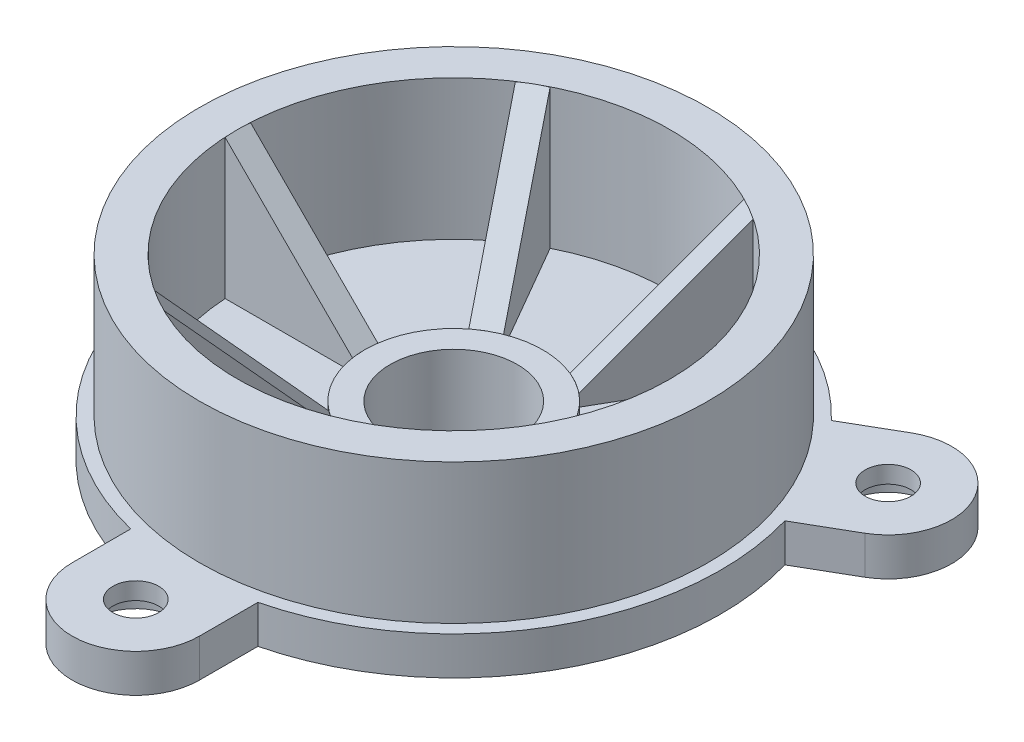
ISO-10303-21;
HEADER;
FILE_DESCRIPTION(('STEP AP214'),'2;1');
FILE_NAME('part.step','',(''),(''),'','','');
FILE_SCHEMA(('AUTOMOTIVE_DESIGN { 1 0 10303 214 1 1 1 1 }'));
ENDSEC;
DATA;
#1=APPLICATION_CONTEXT('core data for automotive mechanical design processes');
#2=APPLICATION_PROTOCOL_DEFINITION('international standard','automotive_design',2000,#1);
#3=PRODUCT_CONTEXT('',#1,'mechanical');
#4=PRODUCT('Part','Part','',(#3));
#5=PRODUCT_RELATED_PRODUCT_CATEGORY('part','',(#4));
#6=PRODUCT_DEFINITION_FORMATION('','',#4);
#7=PRODUCT_DEFINITION_CONTEXT('part definition',#1,'design');
#8=PRODUCT_DEFINITION('design','',#6,#7);
#9=PRODUCT_DEFINITION_SHAPE('','',#8);
#10=(LENGTH_UNIT() NAMED_UNIT(*) SI_UNIT(.MILLI.,.METRE.));
#11=(NAMED_UNIT(*) PLANE_ANGLE_UNIT() SI_UNIT($,.RADIAN.));
#12=(NAMED_UNIT(*) SI_UNIT($,.STERADIAN.) SOLID_ANGLE_UNIT());
#13=UNCERTAINTY_MEASURE_WITH_UNIT(LENGTH_MEASURE(1.E-05),#10,'distance_accuracy_value','');
#14=(GEOMETRIC_REPRESENTATION_CONTEXT(3) GLOBAL_UNCERTAINTY_ASSIGNED_CONTEXT((#13)) GLOBAL_UNIT_ASSIGNED_CONTEXT((#10,
#11,#12)) REPRESENTATION_CONTEXT('',''));
#15=CARTESIAN_POINT('',(0.,0.,0.));
#16=DIRECTION('',(0.,0.,1.));
#17=DIRECTION('',(1.,0.,0.));
#18=AXIS2_PLACEMENT_3D('',#15,#16,#17);
#19=CARTESIAN_POINT('',(0.,91.9242942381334,0.));
#20=DIRECTION('',(0.,1.,0.));
#21=DIRECTION('',(0.,0.,1.));
#22=AXIS2_PLACEMENT_3D('',#19,#20,#21);
#23=CYLINDRICAL_SURFACE('',#22,7.00000000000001);
#24=CARTESIAN_POINT('',(0.,-0.999999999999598,0.));
#25=DIRECTION('',(-0.353553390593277,-0.707106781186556,-0.612372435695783));
#26=DIRECTION('',(-0.353553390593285,0.707106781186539,-0.612372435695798));
#27=AXIS2_PLACEMENT_3D('',#24,#25,#26);
#28=ELLIPSE('',#27,9.89949493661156,7.00000000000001);
#29=CARTESIAN_POINT('',(-3.49999999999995,5.99999999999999,-6.06217782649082));
#30=VERTEX_POINT('',#29);
#31=CARTESIAN_POINT('',(-4.33012701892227,5.92820323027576,-5.49999999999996));
#32=VERTEX_POINT('',#31);
#33=EDGE_CURVE('E49',#30,#32,#28,.F.);
#34=ORIENTED_EDGE('',*,*,#33,.T.);
#35=DIRECTION('',(0.,1.,0.));
#36=VECTOR('',#35,1.);
#37=CARTESIAN_POINT('',(-4.33012701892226,91.9242942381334,-5.49999999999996));
#38=LINE('',#37,#36);
#39=CARTESIAN_POINT('',(-4.33012701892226,5.,-5.49999999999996));
#40=VERTEX_POINT('',#39);
#41=EDGE_CURVE('E340',#32,#40,#38,.F.);
#42=ORIENTED_EDGE('',*,*,#41,.T.);
#43=CARTESIAN_POINT('',(0.,5.,0.));
#44=DIRECTION('',(0.,1.,0.));
#45=DIRECTION('',(0.,0.,1.));
#46=AXIS2_PLACEMENT_3D('',#43,#44,#45);
#47=CIRCLE('',#46,7.00000000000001);
#48=CARTESIAN_POINT('',(-6.92820323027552,5.,-1.));
#49=VERTEX_POINT('',#48);
#50=EDGE_CURVE('E616',#40,#49,#47,.T.);
#51=ORIENTED_EDGE('',*,*,#50,.T.);
#52=DIRECTION('',(0.,1.,0.));
#53=VECTOR('',#52,1.);
#54=CARTESIAN_POINT('',(-6.92820323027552,91.9242942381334,-1.));
#55=LINE('',#54,#53);
#56=CARTESIAN_POINT('',(-6.92820323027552,5.92820323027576,-1.));
#57=VERTEX_POINT('',#56);
#58=EDGE_CURVE('E465',#57,#49,#55,.F.);
#59=ORIENTED_EDGE('',*,*,#58,.F.);
#60=CARTESIAN_POINT('',(0.,-0.999999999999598,0.));
#61=DIRECTION('',(-0.707106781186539,-0.707106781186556,0.));
#62=DIRECTION('',(-0.707106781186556,0.707106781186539,0.));
#63=AXIS2_PLACEMENT_3D('',#60,#61,#62);
#64=ELLIPSE('',#63,9.89949493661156,7.00000000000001);
#65=CARTESIAN_POINT('',(-7.00000000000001,6.00000000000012,0.));
#66=VERTEX_POINT('',#65);
#67=EDGE_CURVE('E478',#57,#66,#64,.F.);
#68=ORIENTED_EDGE('',*,*,#67,.T.);
#69=CARTESIAN_POINT('',(0.,5.99999999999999,0.));
#70=DIRECTION('',(0.,1.,0.));
#71=DIRECTION('',(0.,0.,1.));
#72=AXIS2_PLACEMENT_3D('',#69,#70,#71);
#73=CIRCLE('',#72,7.00000000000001);
#74=EDGE_CURVE('E621',#30,#66,#73,.T.);
#75=ORIENTED_EDGE('',*,*,#74,.F.);
#76=EDGE_LOOP('',(#34,#42,#51,#59,#68,#75));
#77=FACE_BOUND('',#76,.T.);
#78=ADVANCED_FACE('F32',(#77),#23,.T.);
#79=CARTESIAN_POINT('',(0.,91.9242942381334,0.));
#80=DIRECTION('',(0.,1.,0.));
#81=DIRECTION('',(0.,0.,1.));
#82=AXIS2_PLACEMENT_3D('',#79,#80,#81);
#83=CYLINDRICAL_SURFACE('',#82,17.);
#84=CARTESIAN_POINT('',(0.,5.,0.));
#85=DIRECTION('',(0.,1.,0.));
#86=DIRECTION('',(0.,0.,1.));
#87=AXIS2_PLACEMENT_3D('',#84,#85,#86);
#88=CIRCLE('',#87,17.);
#89=CARTESIAN_POINT('',(-9.35130677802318,5.,-14.196938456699));
#90=VERTEX_POINT('',#89);
#91=CARTESIAN_POINT('',(-16.9705627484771,5.,-1.));
#92=VERTEX_POINT('',#91);
#93=EDGE_CURVE('E315',#90,#92,#88,.T.);
#94=ORIENTED_EDGE('',*,*,#93,.F.);
#95=DIRECTION('',(0.,1.,0.));
#96=VECTOR('',#95,1.);
#97=CARTESIAN_POINT('',(-9.35130677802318,91.9242942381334,-14.196938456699));
#98=LINE('',#97,#96);
#99=CARTESIAN_POINT('',(-9.35130677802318,15.9705627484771,-14.196938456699));
#100=VERTEX_POINT('',#99);
#101=EDGE_CURVE('E338',#90,#100,#98,.T.);
#102=ORIENTED_EDGE('',*,*,#101,.T.);
#103=CARTESIAN_POINT('',(0.,-0.999999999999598,0.));
#104=DIRECTION('',(-0.353553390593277,-0.707106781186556,-0.612372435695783));
#105=DIRECTION('',(-0.353553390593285,0.707106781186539,-0.612372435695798));
#106=AXIS2_PLACEMENT_3D('',#103,#104,#105);
#107=ELLIPSE('',#106,24.0416305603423,17.);
#108=CARTESIAN_POINT('',(-8.50000000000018,16.,-14.7224318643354));
#109=VERTEX_POINT('',#108);
#110=EDGE_CURVE('E342',#100,#109,#107,.T.);
#111=ORIENTED_EDGE('',*,*,#110,.T.);
#112=CARTESIAN_POINT('',(0.,16.,0.));
#113=DIRECTION('',(0.,1.,0.));
#114=DIRECTION('',(0.,0.,1.));
#115=AXIS2_PLACEMENT_3D('',#112,#113,#114);
#116=CIRCLE('',#115,17.);
#117=CARTESIAN_POINT('',(-17.,16.,0.));
#118=VERTEX_POINT('',#117);
#119=EDGE_CURVE('E609',#109,#118,#116,.T.);
#120=ORIENTED_EDGE('',*,*,#119,.T.);
#121=CARTESIAN_POINT('',(0.,-0.999999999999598,0.));
#122=DIRECTION('',(-0.707106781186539,-0.707106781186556,0.));
#123=DIRECTION('',(-0.707106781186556,0.707106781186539,0.));
#124=AXIS2_PLACEMENT_3D('',#121,#122,#123);
#125=ELLIPSE('',#124,24.0416305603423,17.);
#126=CARTESIAN_POINT('',(-16.9705627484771,15.9705627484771,-1.));
#127=VERTEX_POINT('',#126);
#128=EDGE_CURVE('E477',#118,#127,#125,.T.);
#129=ORIENTED_EDGE('',*,*,#128,.T.);
#130=DIRECTION('',(0.,1.,0.));
#131=VECTOR('',#130,1.);
#132=CARTESIAN_POINT('',(-16.9705627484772,91.9242942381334,-1.));
#133=LINE('',#132,#131);
#134=EDGE_CURVE('E456',#92,#127,#133,.T.);
#135=ORIENTED_EDGE('',*,*,#134,.F.);
#136=EDGE_LOOP('',(#94,#102,#111,#120,#129,#135));
#137=FACE_BOUND('',#136,.T.);
#138=ADVANCED_FACE('F654',(#137),#83,.F.);
#139=CARTESIAN_POINT('',(7.00000000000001,5.,0.));
#140=DIRECTION('',(0.,-1.,0.));
#141=DIRECTION('',(0.,0.,-1.));
#142=AXIS2_PLACEMENT_3D('',#139,#140,#141);
#143=PLANE('',#142);
#144=DIRECTION('',(-0.50000000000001,0.,-0.866025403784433));
#145=VECTOR('',#144,1.);
#146=CARTESIAN_POINT('',(2.61602540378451,5.,2.53108891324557));
#147=LINE('',#146,#145);
#148=CARTESIAN_POINT('',(-2.5980762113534,5.,-6.49999999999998));
#149=VERTEX_POINT('',#148);
#150=CARTESIAN_POINT('',(-7.61925597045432,5.,-15.196938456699));
#151=VERTEX_POINT('',#150);
#152=EDGE_CURVE('E309',#149,#151,#147,.T.);
#153=ORIENTED_EDGE('',*,*,#152,.F.);
#154=CARTESIAN_POINT('',(2.59807621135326,5.,-6.50000000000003));
#155=VERTEX_POINT('',#154);
#156=EDGE_CURVE('E737',#155,#149,#47,.T.);
#157=ORIENTED_EDGE('',*,*,#156,.F.);
#158=DIRECTION('',(0.499999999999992,0.,-0.866025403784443));
#159=VECTOR('',#158,1.);
#160=CARTESIAN_POINT('',(0.883974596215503,5.,-3.5310889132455));
#161=LINE('',#160,#159);
#162=CARTESIAN_POINT('',(7.619255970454,5.,-15.1969384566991));
#163=VERTEX_POINT('',#162);
#164=EDGE_CURVE('E311',#155,#163,#161,.T.);
#165=ORIENTED_EDGE('',*,*,#164,.T.);
#166=EDGE_CURVE('E304',#163,#151,#88,.T.);
#167=ORIENTED_EDGE('',*,*,#166,.T.);
#168=EDGE_LOOP('',(#153,#157,#165,#167));
#169=FACE_BOUND('',#168,.T.);
#170=ADVANCED_FACE('F306',(#169),#143,.F.);
#171=DIRECTION('',(0.,1.,0.));
#172=VECTOR('',#171,1.);
#173=CARTESIAN_POINT('',(-2.5980762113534,91.9242942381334,-6.49999999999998));
#174=LINE('',#173,#172);
#175=CARTESIAN_POINT('',(-2.5980762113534,5.92820323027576,-6.49999999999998));
#176=VERTEX_POINT('',#175);
#177=EDGE_CURVE('E57',#176,#149,#174,.F.);
#178=ORIENTED_EDGE('',*,*,#177,.F.);
#179=EDGE_CURVE('E344',#176,#30,#28,.F.);
#180=ORIENTED_EDGE('',*,*,#179,.T.);
#181=CARTESIAN_POINT('',(3.49999999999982,5.99999999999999,-6.0621778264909));
#182=VERTEX_POINT('',#181);
#183=EDGE_CURVE('E815',#182,#30,#73,.T.);
#184=ORIENTED_EDGE('',*,*,#183,.F.);
#185=CARTESIAN_POINT('',(0.,-0.999999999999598,0.));
#186=DIRECTION('',(0.353553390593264,-0.707106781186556,-0.61237243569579));
#187=DIRECTION('',(0.353553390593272,0.707106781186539,-0.612372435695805));
#188=AXIS2_PLACEMENT_3D('',#185,#186,#187);
#189=ELLIPSE('',#188,9.89949493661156,7.00000000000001);
#190=CARTESIAN_POINT('',(2.59807621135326,5.92820323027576,-6.50000000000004));
#191=VERTEX_POINT('',#190);
#192=EDGE_CURVE('E371',#182,#191,#189,.F.);
#193=ORIENTED_EDGE('',*,*,#192,.T.);
#194=DIRECTION('',(0.,1.,0.));
#195=VECTOR('',#194,1.);
#196=CARTESIAN_POINT('',(2.59807621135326,91.9242942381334,-6.50000000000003));
#197=LINE('',#196,#195);
#198=EDGE_CURVE('E364',#191,#155,#197,.F.);
#199=ORIENTED_EDGE('',*,*,#198,.T.);
#200=ORIENTED_EDGE('',*,*,#156,.T.);
#201=EDGE_LOOP('',(#178,#180,#184,#193,#199,#200));
#202=FACE_BOUND('',#201,.T.);
#203=ADVANCED_FACE('F656',(#202),#23,.T.);
#204=CARTESIAN_POINT('',(8.49999999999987,16.,-14.7224318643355));
#205=VERTEX_POINT('',#204);
#206=EDGE_CURVE('E826',#205,#109,#116,.T.);
#207=ORIENTED_EDGE('',*,*,#206,.T.);
#208=CARTESIAN_POINT('',(-7.61925597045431,15.9705627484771,-15.196938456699));
#209=VERTEX_POINT('',#208);
#210=EDGE_CURVE('E322',#109,#209,#107,.T.);
#211=ORIENTED_EDGE('',*,*,#210,.T.);
#212=DIRECTION('',(0.,1.,0.));
#213=VECTOR('',#212,1.);
#214=CARTESIAN_POINT('',(-7.61925597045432,91.9242942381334,-15.196938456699));
#215=LINE('',#214,#213);
#216=EDGE_CURVE('E318',#151,#209,#215,.T.);
#217=ORIENTED_EDGE('',*,*,#216,.F.);
#218=ORIENTED_EDGE('',*,*,#166,.F.);
#219=DIRECTION('',(0.,1.,0.));
#220=VECTOR('',#219,1.);
#221=CARTESIAN_POINT('',(7.619255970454,91.9242942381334,-15.1969384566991));
#222=LINE('',#221,#220);
#223=CARTESIAN_POINT('',(7.619255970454,15.9705627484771,-15.1969384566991));
#224=VERTEX_POINT('',#223);
#225=EDGE_CURVE('E362',#163,#224,#222,.T.);
#226=ORIENTED_EDGE('',*,*,#225,.T.);
#227=CARTESIAN_POINT('',(0.,-0.999999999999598,0.));
#228=DIRECTION('',(0.353553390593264,-0.707106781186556,-0.61237243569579));
#229=DIRECTION('',(0.353553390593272,0.707106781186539,-0.612372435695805));
#230=AXIS2_PLACEMENT_3D('',#227,#228,#229);
#231=ELLIPSE('',#230,24.0416305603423,17.);
#232=EDGE_CURVE('E366',#224,#205,#231,.T.);
#233=ORIENTED_EDGE('',*,*,#232,.T.);
#234=EDGE_LOOP('',(#207,#211,#217,#218,#226,#233));
#235=FACE_BOUND('',#234,.T.);
#236=ADVANCED_FACE('F320',(#235),#83,.F.);
#237=DIRECTION('',(0.499999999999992,0.,-0.866025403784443));
#238=VECTOR('',#237,1.);
#239=CARTESIAN_POINT('',(2.61602540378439,5.,-2.53108891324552));
#240=LINE('',#239,#238);
#241=CARTESIAN_POINT('',(4.33012701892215,5.,-5.50000000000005));
#242=VERTEX_POINT('',#241);
#243=CARTESIAN_POINT('',(9.35130677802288,5.,-14.1969384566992));
#244=VERTEX_POINT('',#243);
#245=EDGE_CURVE('E349',#242,#244,#240,.T.);
#246=ORIENTED_EDGE('',*,*,#245,.F.);
#247=CARTESIAN_POINT('',(6.92820323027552,5.,-1.));
#248=VERTEX_POINT('',#247);
#249=EDGE_CURVE('E717',#248,#242,#47,.T.);
#250=ORIENTED_EDGE('',*,*,#249,.F.);
#251=DIRECTION('',(1.,0.,0.));
#252=VECTOR('',#251,1.);
#253=CARTESIAN_POINT('',(7.00000000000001,5.,-1.));
#254=LINE('',#253,#252);
#255=CARTESIAN_POINT('',(16.9705627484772,5.,-1.));
#256=VERTEX_POINT('',#255);
#257=EDGE_CURVE('E387',#248,#256,#254,.T.);
#258=ORIENTED_EDGE('',*,*,#257,.T.);
#259=EDGE_CURVE('E314',#256,#244,#88,.T.);
#260=ORIENTED_EDGE('',*,*,#259,.T.);
#261=EDGE_LOOP('',(#246,#250,#258,#260));
#262=FACE_BOUND('',#261,.T.);
#263=ADVANCED_FACE('F703',(#262),#143,.F.);
#264=DIRECTION('',(0.,1.,0.));
#265=VECTOR('',#264,1.);
#266=CARTESIAN_POINT('',(4.33012701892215,91.9242942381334,-5.50000000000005));
#267=LINE('',#266,#265);
#268=CARTESIAN_POINT('',(4.33012701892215,5.92820323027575,-5.50000000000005));
#269=VERTEX_POINT('',#268);
#270=EDGE_CURVE('E358',#269,#242,#267,.F.);
#271=ORIENTED_EDGE('',*,*,#270,.F.);
#272=EDGE_CURVE('E369',#269,#182,#189,.F.);
#273=ORIENTED_EDGE('',*,*,#272,.T.);
#274=CARTESIAN_POINT('',(6.99999999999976,5.99999999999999,0.));
#275=VERTEX_POINT('',#274);
#276=EDGE_CURVE('E814',#275,#182,#73,.T.);
#277=ORIENTED_EDGE('',*,*,#276,.F.);
#278=CARTESIAN_POINT('',(0.,-0.999999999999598,0.));
#279=DIRECTION('',(0.707106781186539,-0.707106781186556,0.));
#280=DIRECTION('',(0.707106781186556,0.707106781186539,0.));
#281=AXIS2_PLACEMENT_3D('',#278,#279,#280);
#282=ELLIPSE('',#281,9.89949493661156,7.00000000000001);
#283=CARTESIAN_POINT('',(6.92820323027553,5.92820323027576,-1.));
#284=VERTEX_POINT('',#283);
#285=EDGE_CURVE('E398',#275,#284,#282,.F.);
#286=ORIENTED_EDGE('',*,*,#285,.T.);
#287=DIRECTION('',(0.,1.,0.));
#288=VECTOR('',#287,1.);
#289=CARTESIAN_POINT('',(6.92820323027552,91.9242942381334,-1.));
#290=LINE('',#289,#288);
#291=EDGE_CURVE('E391',#284,#248,#290,.F.);
#292=ORIENTED_EDGE('',*,*,#291,.T.);
#293=ORIENTED_EDGE('',*,*,#249,.T.);
#294=EDGE_LOOP('',(#271,#273,#277,#286,#292,#293));
#295=FACE_BOUND('',#294,.T.);
#296=ADVANCED_FACE('F667',(#295),#23,.T.);
#297=CARTESIAN_POINT('',(17.,16.,0.));
#298=VERTEX_POINT('',#297);
#299=EDGE_CURVE('E730',#298,#205,#116,.T.);
#300=ORIENTED_EDGE('',*,*,#299,.T.);
#301=CARTESIAN_POINT('',(9.35130677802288,15.9705627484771,-14.1969384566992));
#302=VERTEX_POINT('',#301);
#303=EDGE_CURVE('E368',#205,#302,#231,.T.);
#304=ORIENTED_EDGE('',*,*,#303,.T.);
#305=DIRECTION('',(0.,1.,0.));
#306=VECTOR('',#305,1.);
#307=CARTESIAN_POINT('',(9.35130677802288,91.9242942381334,-14.1969384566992));
#308=LINE('',#307,#306);
#309=EDGE_CURVE('E355',#244,#302,#308,.T.);
#310=ORIENTED_EDGE('',*,*,#309,.F.);
#311=ORIENTED_EDGE('',*,*,#259,.F.);
#312=DIRECTION('',(0.,1.,0.));
#313=VECTOR('',#312,1.);
#314=CARTESIAN_POINT('',(16.9705627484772,91.9242942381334,-1.));
#315=LINE('',#314,#313);
#316=CARTESIAN_POINT('',(16.9705627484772,15.9705627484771,-1.));
#317=VERTEX_POINT('',#316);
#318=EDGE_CURVE('E389',#256,#317,#315,.T.);
#319=ORIENTED_EDGE('',*,*,#318,.T.);
#320=CARTESIAN_POINT('',(0.,-0.999999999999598,0.));
#321=DIRECTION('',(0.707106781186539,-0.707106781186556,0.));
#322=DIRECTION('',(0.707106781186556,0.707106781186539,0.));
#323=AXIS2_PLACEMENT_3D('',#320,#321,#322);
#324=ELLIPSE('',#323,24.0416305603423,17.);
#325=EDGE_CURVE('E393',#317,#298,#324,.T.);
#326=ORIENTED_EDGE('',*,*,#325,.T.);
#327=EDGE_LOOP('',(#300,#304,#310,#311,#319,#326));
#328=FACE_BOUND('',#327,.T.);
#329=ADVANCED_FACE('F701',(#328),#83,.F.);
#330=DIRECTION('',(1.,0.,0.));
#331=VECTOR('',#330,1.);
#332=CARTESIAN_POINT('',(7.00000000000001,5.,1.));
#333=LINE('',#332,#331);
#334=CARTESIAN_POINT('',(6.92820323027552,5.,1.));
#335=VERTEX_POINT('',#334);
#336=CARTESIAN_POINT('',(16.9705627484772,5.,1.));
#337=VERTEX_POINT('',#336);
#338=EDGE_CURVE('E375',#335,#337,#333,.T.);
#339=ORIENTED_EDGE('',*,*,#338,.F.);
#340=CARTESIAN_POINT('',(4.33012701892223,5.,5.49999999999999));
#341=VERTEX_POINT('',#340);
#342=EDGE_CURVE('E738',#341,#335,#47,.T.);
#343=ORIENTED_EDGE('',*,*,#342,.F.);
#344=DIRECTION('',(0.500000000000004,0.,0.866025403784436));
#345=VECTOR('',#344,1.);
#346=CARTESIAN_POINT('',(2.61602540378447,5.,2.53108891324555));
#347=LINE('',#346,#345);
#348=CARTESIAN_POINT('',(9.35130677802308,5.,14.196938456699));
#349=VERTEX_POINT('',#348);
#350=EDGE_CURVE('E414',#341,#349,#347,.T.);
#351=ORIENTED_EDGE('',*,*,#350,.T.);
#352=EDGE_CURVE('E779',#349,#337,#88,.T.);
#353=ORIENTED_EDGE('',*,*,#352,.T.);
#354=EDGE_LOOP('',(#339,#343,#351,#353));
#355=FACE_BOUND('',#354,.T.);
#356=ADVANCED_FACE('F693',(#355),#143,.F.);
#357=DIRECTION('',(0.,1.,0.));
#358=VECTOR('',#357,1.);
#359=CARTESIAN_POINT('',(6.92820323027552,91.9242942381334,1.));
#360=LINE('',#359,#358);
#361=CARTESIAN_POINT('',(6.92820323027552,5.92820323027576,1.));
#362=VERTEX_POINT('',#361);
#363=EDGE_CURVE('E384',#362,#335,#360,.F.);
#364=ORIENTED_EDGE('',*,*,#363,.F.);
#365=EDGE_CURVE('E396',#362,#275,#282,.F.);
#366=ORIENTED_EDGE('',*,*,#365,.T.);
#367=CARTESIAN_POINT('',(3.49999999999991,5.99999999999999,6.06217782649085));
#368=VERTEX_POINT('',#367);
#369=EDGE_CURVE('E812',#368,#275,#73,.T.);
#370=ORIENTED_EDGE('',*,*,#369,.F.);
#371=CARTESIAN_POINT('',(0.,-0.999999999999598,0.));
#372=DIRECTION('',(0.353553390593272,-0.707106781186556,0.612372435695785));
#373=DIRECTION('',(0.353553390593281,0.707106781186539,0.6123724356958));
#374=AXIS2_PLACEMENT_3D('',#371,#372,#373);
#375=ELLIPSE('',#374,9.89949493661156,7.00000000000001);
#376=CARTESIAN_POINT('',(4.33012701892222,5.92820323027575,5.49999999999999));
#377=VERTEX_POINT('',#376);
#378=EDGE_CURVE('E425',#368,#377,#375,.F.);
#379=ORIENTED_EDGE('',*,*,#378,.T.);
#380=DIRECTION('',(0.,1.,0.));
#381=VECTOR('',#380,1.);
#382=CARTESIAN_POINT('',(4.33012701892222,91.9242942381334,5.49999999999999));
#383=LINE('',#382,#381);
#384=EDGE_CURVE('E418',#377,#341,#383,.F.);
#385=ORIENTED_EDGE('',*,*,#384,.T.);
#386=ORIENTED_EDGE('',*,*,#342,.T.);
#387=EDGE_LOOP('',(#364,#366,#370,#379,#385,#386));
#388=FACE_BOUND('',#387,.T.);
#389=ADVANCED_FACE('F684',(#388),#23,.T.);
#390=CARTESIAN_POINT('',(8.50000000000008,16.,14.7224318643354));
#391=VERTEX_POINT('',#390);
#392=EDGE_CURVE('E796',#391,#298,#116,.T.);
#393=ORIENTED_EDGE('',*,*,#392,.T.);
#394=CARTESIAN_POINT('',(16.9705627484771,15.9705627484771,1.));
#395=VERTEX_POINT('',#394);
#396=EDGE_CURVE('E395',#298,#395,#324,.T.);
#397=ORIENTED_EDGE('',*,*,#396,.T.);
#398=DIRECTION('',(0.,1.,0.));
#399=VECTOR('',#398,1.);
#400=CARTESIAN_POINT('',(16.9705627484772,91.9242942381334,1.));
#401=LINE('',#400,#399);
#402=EDGE_CURVE('E381',#337,#395,#401,.T.);
#403=ORIENTED_EDGE('',*,*,#402,.F.);
#404=ORIENTED_EDGE('',*,*,#352,.F.);
#405=DIRECTION('',(0.,1.,0.));
#406=VECTOR('',#405,1.);
#407=CARTESIAN_POINT('',(9.35130677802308,91.9242942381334,14.196938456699));
#408=LINE('',#407,#406);
#409=CARTESIAN_POINT('',(9.35130677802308,15.9705627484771,14.196938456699));
#410=VERTEX_POINT('',#409);
#411=EDGE_CURVE('E416',#349,#410,#408,.T.);
#412=ORIENTED_EDGE('',*,*,#411,.T.);
#413=CARTESIAN_POINT('',(0.,-0.999999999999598,0.));
#414=DIRECTION('',(0.353553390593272,-0.707106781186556,0.612372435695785));
#415=DIRECTION('',(0.353553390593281,0.707106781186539,0.6123724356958));
#416=AXIS2_PLACEMENT_3D('',#413,#414,#415);
#417=ELLIPSE('',#416,24.0416305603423,17.);
#418=EDGE_CURVE('E420',#410,#391,#417,.T.);
#419=ORIENTED_EDGE('',*,*,#418,.T.);
#420=EDGE_LOOP('',(#393,#397,#403,#404,#412,#419));
#421=FACE_BOUND('',#420,.T.);
#422=ADVANCED_FACE('F691',(#421),#83,.F.);
#423=DIRECTION('',(0.500000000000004,0.,0.866025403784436));
#424=VECTOR('',#423,1.);
#425=CARTESIAN_POINT('',(0.883974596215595,5.,3.53108891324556));
#426=LINE('',#425,#424);
#427=CARTESIAN_POINT('',(2.59807621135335,5.,6.5));
#428=VERTEX_POINT('',#427);
#429=CARTESIAN_POINT('',(7.61925597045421,5.,15.196938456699));
#430=VERTEX_POINT('',#429);
#431=EDGE_CURVE('E402',#428,#430,#426,.T.);
#432=ORIENTED_EDGE('',*,*,#431,.F.);
#433=CARTESIAN_POINT('',(-2.59807621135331,5.,6.50000000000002));
#434=VERTEX_POINT('',#433);
#435=EDGE_CURVE('E622',#434,#428,#47,.T.);
#436=ORIENTED_EDGE('',*,*,#435,.F.);
#437=DIRECTION('',(-0.499999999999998,0.,0.86602540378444));
#438=VECTOR('',#437,1.);
#439=CARTESIAN_POINT('',(2.61602540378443,5.,-2.53108891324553));
#440=LINE('',#439,#438);
#441=CARTESIAN_POINT('',(-7.6192559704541,5.,15.1969384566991));
#442=VERTEX_POINT('',#441);
#443=EDGE_CURVE('E443',#434,#442,#440,.T.);
#444=ORIENTED_EDGE('',*,*,#443,.T.);
#445=EDGE_CURVE('E617',#442,#430,#88,.T.);
#446=ORIENTED_EDGE('',*,*,#445,.T.);
#447=EDGE_LOOP('',(#432,#436,#444,#446));
#448=FACE_BOUND('',#447,.T.);
#449=ADVANCED_FACE('F682',(#448),#143,.F.);
#450=DIRECTION('',(0.,1.,0.));
#451=VECTOR('',#450,1.);
#452=CARTESIAN_POINT('',(2.59807621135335,91.9242942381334,6.5));
#453=LINE('',#452,#451);
#454=CARTESIAN_POINT('',(2.59807621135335,5.92820323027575,6.5));
#455=VERTEX_POINT('',#454);
#456=EDGE_CURVE('E411',#455,#428,#453,.F.);
#457=ORIENTED_EDGE('',*,*,#456,.F.);
#458=EDGE_CURVE('E423',#455,#368,#375,.F.);
#459=ORIENTED_EDGE('',*,*,#458,.T.);
#460=CARTESIAN_POINT('',(-3.49999999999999,6.00000000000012,6.06217782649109));
#461=VERTEX_POINT('',#460);
#462=EDGE_CURVE('E626',#461,#368,#73,.T.);
#463=ORIENTED_EDGE('',*,*,#462,.F.);
#464=CARTESIAN_POINT('',(0.,-0.999999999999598,0.));
#465=DIRECTION('',(-0.353553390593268,-0.707106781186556,0.612372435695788));
#466=DIRECTION('',(-0.353553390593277,0.707106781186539,0.612372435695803));
#467=AXIS2_PLACEMENT_3D('',#464,#465,#466);
#468=ELLIPSE('',#467,9.89949493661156,7.00000000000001);
#469=CARTESIAN_POINT('',(-2.59807621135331,5.92820323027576,6.50000000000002));
#470=VERTEX_POINT('',#469);
#471=EDGE_CURVE('E452',#461,#470,#468,.F.);
#472=ORIENTED_EDGE('',*,*,#471,.T.);
#473=DIRECTION('',(0.,1.,0.));
#474=VECTOR('',#473,1.);
#475=CARTESIAN_POINT('',(-2.59807621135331,91.9242942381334,6.50000000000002));
#476=LINE('',#475,#474);
#477=EDGE_CURVE('E445',#470,#434,#476,.F.);
#478=ORIENTED_EDGE('',*,*,#477,.T.);
#479=ORIENTED_EDGE('',*,*,#435,.T.);
#480=EDGE_LOOP('',(#457,#459,#463,#472,#478,#479));
#481=FACE_BOUND('',#480,.T.);
#482=ADVANCED_FACE('F672',(#481),#23,.T.);
#483=DIRECTION('',(-0.499999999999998,0.,0.86602540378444));
#484=VECTOR('',#483,1.);
#485=CARTESIAN_POINT('',(0.88397459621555,5.,-3.53108891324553));
#486=LINE('',#485,#484);
#487=CARTESIAN_POINT('',(-4.33012701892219,5.,5.50000000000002));
#488=VERTEX_POINT('',#487);
#489=CARTESIAN_POINT('',(-9.35130677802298,5.,14.1969384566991));
#490=VERTEX_POINT('',#489);
#491=EDGE_CURVE('E435',#488,#490,#486,.T.);
#492=ORIENTED_EDGE('',*,*,#491,.F.);
#493=CARTESIAN_POINT('',(-6.92820323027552,5.,1.));
#494=VERTEX_POINT('',#493);
#495=EDGE_CURVE('E618',#494,#488,#47,.T.);
#496=ORIENTED_EDGE('',*,*,#495,.F.);
#497=DIRECTION('',(-1.,0.,0.));
#498=VECTOR('',#497,1.);
#499=CARTESIAN_POINT('',(7.00000000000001,5.,1.));
#500=LINE('',#499,#498);
#501=CARTESIAN_POINT('',(-16.9705627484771,5.,1.));
#502=VERTEX_POINT('',#501);
#503=EDGE_CURVE('E470',#494,#502,#500,.T.);
#504=ORIENTED_EDGE('',*,*,#503,.T.);
#505=EDGE_CURVE('E613',#502,#490,#88,.T.);
#506=ORIENTED_EDGE('',*,*,#505,.T.);
#507=EDGE_LOOP('',(#492,#496,#504,#506));
#508=FACE_BOUND('',#507,.T.);
#509=ADVANCED_FACE('F678',(#508),#143,.F.);
#510=CARTESIAN_POINT('',(-8.49999999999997,16.,14.7224318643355));
#511=VERTEX_POINT('',#510);
#512=EDGE_CURVE('E612',#511,#391,#116,.T.);
#513=ORIENTED_EDGE('',*,*,#512,.T.);
#514=CARTESIAN_POINT('',(7.61925597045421,15.9705627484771,15.196938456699));
#515=VERTEX_POINT('',#514);
#516=EDGE_CURVE('E422',#391,#515,#417,.T.);
#517=ORIENTED_EDGE('',*,*,#516,.T.);
#518=DIRECTION('',(0.,1.,0.));
#519=VECTOR('',#518,1.);
#520=CARTESIAN_POINT('',(7.61925597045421,91.9242942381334,15.196938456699));
#521=LINE('',#520,#519);
#522=EDGE_CURVE('E408',#430,#515,#521,.T.);
#523=ORIENTED_EDGE('',*,*,#522,.F.);
#524=ORIENTED_EDGE('',*,*,#445,.F.);
#525=DIRECTION('',(0.,1.,0.));
#526=VECTOR('',#525,1.);
#527=CARTESIAN_POINT('',(-7.6192559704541,91.9242942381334,15.1969384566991));
#528=LINE('',#527,#526);
#529=CARTESIAN_POINT('',(-7.6192559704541,15.9705627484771,15.1969384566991));
#530=VERTEX_POINT('',#529);
#531=EDGE_CURVE('E441',#442,#530,#528,.T.);
#532=ORIENTED_EDGE('',*,*,#531,.T.);
#533=CARTESIAN_POINT('',(0.,-0.999999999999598,0.));
#534=DIRECTION('',(-0.353553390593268,-0.707106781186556,0.612372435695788));
#535=DIRECTION('',(-0.353553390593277,0.707106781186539,0.612372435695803));
#536=AXIS2_PLACEMENT_3D('',#533,#534,#535);
#537=ELLIPSE('',#536,24.0416305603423,17.);
#538=EDGE_CURVE('E447',#530,#511,#537,.T.);
#539=ORIENTED_EDGE('',*,*,#538,.T.);
#540=EDGE_LOOP('',(#513,#517,#523,#524,#532,#539));
#541=FACE_BOUND('',#540,.T.);
#542=ADVANCED_FACE('F689',(#541),#83,.F.);
#543=CARTESIAN_POINT('',(21.,2.,0.));
#544=DIRECTION('',(0.,1.,0.));
#545=DIRECTION('',(0.,0.,1.));
#546=AXIS2_PLACEMENT_3D('',#543,#544,#545);
#547=PLANE('',#546);
#548=CARTESIAN_POINT('',(0.,2.,0.));
#549=DIRECTION('',(0.,1.,0.));
#550=DIRECTION('',(0.,0.,1.));
#551=AXIS2_PLACEMENT_3D('',#548,#549,#550);
#552=CIRCLE('',#551,10.);
#553=CARTESIAN_POINT('',(0.,2.,10.));
#554=VERTEX_POINT('',#553);
#555=EDGE_CURVE('E592',#554,#554,#552,.T.);
#556=ORIENTED_EDGE('',*,*,#555,.T.);
#557=EDGE_LOOP('',(#556));
#558=FACE_BOUND('',#557,.T.);
#559=CARTESIAN_POINT('',(21.6506350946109,2.,-12.5000000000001));
#560=DIRECTION('',(0.,-1.,0.));
#561=DIRECTION('',(0.,0.,-1.));
#562=AXIS2_PLACEMENT_3D('',#559,#560,#561);
#563=CIRCLE('',#562,3.35);
#564=CARTESIAN_POINT('',(21.6506350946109,2.,-15.8500000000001));
#565=VERTEX_POINT('',#564);
#566=EDGE_CURVE('E491',#565,#565,#563,.T.);
#567=ORIENTED_EDGE('',*,*,#566,.F.);
#568=EDGE_LOOP('',(#567));
#569=FACE_BOUND('',#568,.T.);
#570=CARTESIAN_POINT('',(0.,2.,25.));
#571=DIRECTION('',(0.,-1.,0.));
#572=DIRECTION('',(0.,0.,-1.));
#573=AXIS2_PLACEMENT_3D('',#570,#571,#572);
#574=CIRCLE('',#573,3.35);
#575=CARTESIAN_POINT('',(0.,2.,21.65));
#576=VERTEX_POINT('',#575);
#577=EDGE_CURVE('E553',#576,#576,#574,.T.);
#578=ORIENTED_EDGE('',*,*,#577,.F.);
#579=EDGE_LOOP('',(#578));
#580=FACE_BOUND('',#579,.T.);
#581=DIRECTION('',(0.866025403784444,0.,0.499999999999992));
#582=VECTOR('',#581,1.);
#583=CARTESIAN_POINT('',(-14.2705098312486,2.,-14.0125853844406));
#584=LINE('',#583,#582);
#585=CARTESIAN_POINT('',(-19.1506350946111,2.,-16.830127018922));
#586=VERTEX_POINT('',#585);
#587=CARTESIAN_POINT('',(-15.1635217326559,2.,-14.5281660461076));
#588=VERTEX_POINT('',#587);
#589=EDGE_CURVE('E506',#586,#588,#584,.T.);
#590=ORIENTED_EDGE('',*,*,#589,.T.);
#591=CARTESIAN_POINT('',(0.,2.,0.));
#592=DIRECTION('',(0.,1.,0.));
#593=DIRECTION('',(0.,0.,1.));
#594=AXIS2_PLACEMENT_3D('',#591,#592,#593);
#595=CIRCLE('',#594,21.);
#596=CARTESIAN_POINT('',(15.1635217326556,2.,-14.5281660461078));
#597=VERTEX_POINT('',#596);
#598=EDGE_CURVE('E599',#597,#588,#595,.T.);
#599=ORIENTED_EDGE('',*,*,#598,.F.);
#600=DIRECTION('',(0.866025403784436,0.,-0.500000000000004));
#601=VECTOR('',#600,1.);
#602=CARTESIAN_POINT('',(19.1506350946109,2.,-16.8301270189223));
#603=LINE('',#602,#601);
#604=CARTESIAN_POINT('',(19.1506350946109,2.,-16.8301270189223));
#605=VERTEX_POINT('',#604);
#606=EDGE_CURVE('E530',#597,#605,#603,.T.);
#607=ORIENTED_EDGE('',*,*,#606,.T.);
#608=CARTESIAN_POINT('',(21.6506350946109,2.,-12.5000000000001));
#609=DIRECTION('',(0.,1.,0.));
#610=DIRECTION('',(0.,0.,1.));
#611=AXIS2_PLACEMENT_3D('',#608,#609,#610);
#612=CIRCLE('',#611,5.);
#613=CARTESIAN_POINT('',(24.1506350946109,2.,-8.16987298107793));
#614=VERTEX_POINT('',#613);
#615=EDGE_CURVE('E528',#605,#614,#612,.F.);
#616=ORIENTED_EDGE('',*,*,#615,.T.);
#617=DIRECTION('',(-0.866025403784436,0.,0.500000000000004));
#618=VECTOR('',#617,1.);
#619=CARTESIAN_POINT('',(19.2705098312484,2.,-5.35233134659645));
#620=LINE('',#619,#618);
#621=CARTESIAN_POINT('',(20.1635217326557,2.,-5.86791200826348));
#622=VERTEX_POINT('',#621);
#623=EDGE_CURVE('E533',#614,#622,#620,.T.);
#624=ORIENTED_EDGE('',*,*,#623,.T.);
#625=CARTESIAN_POINT('',(5.,2.,20.3960780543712));
#626=VERTEX_POINT('',#625);
#627=EDGE_CURVE('E596',#626,#622,#595,.T.);
#628=ORIENTED_EDGE('',*,*,#627,.F.);
#629=DIRECTION('',(0.,0.,1.));
#630=VECTOR('',#629,1.);
#631=CARTESIAN_POINT('',(5.,2.,25.));
#632=LINE('',#631,#630);
#633=CARTESIAN_POINT('',(5.,2.,25.));
#634=VERTEX_POINT('',#633);
#635=EDGE_CURVE('E565',#626,#634,#632,.T.);
#636=ORIENTED_EDGE('',*,*,#635,.T.);
#637=CARTESIAN_POINT('',(0.,2.,25.));
#638=DIRECTION('',(0.,1.,0.));
#639=DIRECTION('',(0.,0.,1.));
#640=AXIS2_PLACEMENT_3D('',#637,#638,#639);
#641=CIRCLE('',#640,5.);
#642=CARTESIAN_POINT('',(-4.99999999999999,2.,25.));
#643=VERTEX_POINT('',#642);
#644=EDGE_CURVE('E563',#634,#643,#641,.F.);
#645=ORIENTED_EDGE('',*,*,#644,.T.);
#646=DIRECTION('',(0.,0.,-1.));
#647=VECTOR('',#646,1.);
#648=CARTESIAN_POINT('',(-5.,2.,19.3649167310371));
#649=LINE('',#648,#647);
#650=CARTESIAN_POINT('',(-5.,2.,20.3960780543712));
#651=VERTEX_POINT('',#650);
#652=EDGE_CURVE('E568',#643,#651,#649,.T.);
#653=ORIENTED_EDGE('',*,*,#652,.T.);
#654=CARTESIAN_POINT('',(-20.1635217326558,2.,-5.8679120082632));
#655=VERTEX_POINT('',#654);
#656=EDGE_CURVE('E595',#655,#651,#595,.T.);
#657=ORIENTED_EDGE('',*,*,#656,.F.);
#658=DIRECTION('',(-0.866025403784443,0.,-0.499999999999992));
#659=VECTOR('',#658,1.);
#660=CARTESIAN_POINT('',(-24.150635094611,2.,-8.16987298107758));
#661=LINE('',#660,#659);
#662=CARTESIAN_POINT('',(-24.150635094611,2.,-8.16987298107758));
#663=VERTEX_POINT('',#662);
#664=EDGE_CURVE('E503',#655,#663,#661,.T.);
#665=ORIENTED_EDGE('',*,*,#664,.T.);
#666=CARTESIAN_POINT('',(-21.6506350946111,2.,-12.4999999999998));
#667=DIRECTION('',(0.,1.,0.));
#668=DIRECTION('',(0.,0.,1.));
#669=AXIS2_PLACEMENT_3D('',#666,#667,#668);
#670=CIRCLE('',#669,5.);
#671=EDGE_CURVE('E501',#663,#586,#670,.F.);
#672=ORIENTED_EDGE('',*,*,#671,.T.);
#673=EDGE_LOOP('',(#590,#599,#607,#616,#624,#628,#636,#645,#653,#657,#665,#672));
#674=FACE_BOUND('',#673,.T.);
#675=CARTESIAN_POINT('',(-21.6506350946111,2.,-12.4999999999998));
#676=DIRECTION('',(0.,-1.,0.));
#677=DIRECTION('',(0.,0.,-1.));
#678=AXIS2_PLACEMENT_3D('',#675,#676,#677);
#679=CIRCLE('',#678,3.35);
#680=CARTESIAN_POINT('',(-21.6506350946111,2.,-15.8499999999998));
#681=VERTEX_POINT('',#680);
#682=EDGE_CURVE('E482',#681,#681,#679,.T.);
#683=ORIENTED_EDGE('',*,*,#682,.F.);
#684=EDGE_LOOP('',(#683));
#685=FACE_BOUND('',#684,.T.);
#686=ADVANCED_FACE('F872',(#558,#569,#580,#674,#685),#547,.F.);
#687=CARTESIAN_POINT('',(0.,91.9242942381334,0.));
#688=DIRECTION('',(0.,1.,0.));
#689=DIRECTION('',(0.,0.,1.));
#690=AXIS2_PLACEMENT_3D('',#687,#688,#689);
#691=CYLINDRICAL_SURFACE('',#690,21.);
#692=DIRECTION('',(0.,1.,0.));
#693=VECTOR('',#692,1.);
#694=CARTESIAN_POINT('',(-5.,91.9242942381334,20.3960780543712));
#695=LINE('',#694,#693);
#696=CARTESIAN_POINT('',(-4.99999999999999,5.,20.3960780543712));
#697=VERTEX_POINT('',#696);
#698=EDGE_CURVE('E583',#651,#697,#695,.T.);
#699=ORIENTED_EDGE('',*,*,#698,.T.);
#700=CARTESIAN_POINT('',(0.,5.,0.));
#701=DIRECTION('',(0.,1.,0.));
#702=DIRECTION('',(0.,0.,1.));
#703=AXIS2_PLACEMENT_3D('',#700,#701,#702);
#704=CIRCLE('',#703,21.);
#705=CARTESIAN_POINT('',(-20.1635217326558,5.,-5.86791200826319));
#706=VERTEX_POINT('',#705);
#707=EDGE_CURVE('E598',#706,#697,#704,.T.);
#708=ORIENTED_EDGE('',*,*,#707,.F.);
#709=DIRECTION('',(0.,1.,0.));
#710=VECTOR('',#709,1.);
#711=CARTESIAN_POINT('',(-20.1635217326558,91.9242942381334,-5.8679120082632));
#712=LINE('',#711,#710);
#713=EDGE_CURVE('E524',#706,#655,#712,.F.);
#714=ORIENTED_EDGE('',*,*,#713,.T.);
#715=ORIENTED_EDGE('',*,*,#656,.T.);
#716=EDGE_LOOP('',(#699,#708,#714,#715));
#717=FACE_BOUND('',#716,.T.);
#718=ADVANCED_FACE('F875',(#717),#691,.T.);
#719=DIRECTION('',(0.,1.,0.));
#720=VECTOR('',#719,1.);
#721=CARTESIAN_POINT('',(-15.1635217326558,91.9242942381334,-14.5281660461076));
#722=LINE('',#721,#720);
#723=CARTESIAN_POINT('',(-15.1635217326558,5.,-14.5281660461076));
#724=VERTEX_POINT('',#723);
#725=EDGE_CURVE('E521',#588,#724,#722,.T.);
#726=ORIENTED_EDGE('',*,*,#725,.T.);
#727=CARTESIAN_POINT('',(15.1635217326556,5.,-14.5281660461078));
#728=VERTEX_POINT('',#727);
#729=EDGE_CURVE('E603',#728,#724,#704,.T.);
#730=ORIENTED_EDGE('',*,*,#729,.F.);
#731=DIRECTION('',(0.,1.,0.));
#732=VECTOR('',#731,1.);
#733=CARTESIAN_POINT('',(15.1635217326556,91.9242942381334,-14.5281660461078));
#734=LINE('',#733,#732);
#735=EDGE_CURVE('E550',#728,#597,#734,.F.);
#736=ORIENTED_EDGE('',*,*,#735,.T.);
#737=ORIENTED_EDGE('',*,*,#598,.T.);
#738=EDGE_LOOP('',(#726,#730,#736,#737));
#739=FACE_BOUND('',#738,.T.);
#740=ADVANCED_FACE('F891',(#739),#691,.T.);
#741=CARTESIAN_POINT('',(10.,0.,0.));
#742=DIRECTION('',(0.,1.,0.));
#743=DIRECTION('',(0.,0.,1.));
#744=AXIS2_PLACEMENT_3D('',#741,#742,#743);
#745=PLANE('',#744);
#746=CARTESIAN_POINT('',(0.,0.,0.));
#747=DIRECTION('',(0.,1.,0.));
#748=DIRECTION('',(0.,0.,1.));
#749=AXIS2_PLACEMENT_3D('',#746,#747,#748);
#750=CIRCLE('',#749,5.00000000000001);
#751=CARTESIAN_POINT('',(0.,0.,5.00000000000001));
#752=VERTEX_POINT('',#751);
#753=EDGE_CURVE('E11',#752,#752,#750,.T.);
#754=ORIENTED_EDGE('',*,*,#753,.T.);
#755=EDGE_LOOP('',(#754));
#756=FACE_BOUND('',#755,.T.);
#757=CARTESIAN_POINT('',(0.,0.,0.));
#758=DIRECTION('',(0.,1.,0.));
#759=DIRECTION('',(0.,0.,1.));
#760=AXIS2_PLACEMENT_3D('',#757,#758,#759);
#761=CIRCLE('',#760,10.);
#762=CARTESIAN_POINT('',(0.,0.,10.));
#763=VERTEX_POINT('',#762);
#764=EDGE_CURVE('E589',#763,#763,#761,.T.);
#765=ORIENTED_EDGE('',*,*,#764,.F.);
#766=EDGE_LOOP('',(#765));
#767=FACE_BOUND('',#766,.T.);
#768=ADVANCED_FACE('F34',(#756,#767),#745,.F.);
#769=CARTESIAN_POINT('',(0.,91.9242942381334,0.));
#770=DIRECTION('',(0.,1.,0.));
#771=DIRECTION('',(0.,0.,1.));
#772=AXIS2_PLACEMENT_3D('',#769,#770,#771);
#773=CYLINDRICAL_SURFACE('',#772,5.00000000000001);
#774=ORIENTED_EDGE('',*,*,#753,.F.);
#775=EDGE_LOOP('',(#774));
#776=FACE_BOUND('',#775,.T.);
#777=CARTESIAN_POINT('',(0.,5.99999999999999,0.));
#778=DIRECTION('',(0.,1.,0.));
#779=DIRECTION('',(0.,0.,1.));
#780=AXIS2_PLACEMENT_3D('',#777,#778,#779);
#781=CIRCLE('',#780,5.00000000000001);
#782=CARTESIAN_POINT('',(0.,5.99999999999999,5.00000000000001));
#783=VERTEX_POINT('',#782);
#784=EDGE_CURVE('E41',#783,#783,#781,.T.);
#785=ORIENTED_EDGE('',*,*,#784,.T.);
#786=EDGE_LOOP('',(#785));
#787=FACE_BOUND('',#786,.T.);
#788=ADVANCED_FACE('F679',(#776,#787),#773,.F.);
#789=CARTESIAN_POINT('',(5.00000000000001,5.99999999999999,0.));
#790=DIRECTION('',(0.,-1.,0.));
#791=DIRECTION('',(0.,0.,-1.));
#792=AXIS2_PLACEMENT_3D('',#789,#790,#791);
#793=PLANE('',#792);
#794=ORIENTED_EDGE('',*,*,#784,.F.);
#795=EDGE_LOOP('',(#794));
#796=FACE_BOUND('',#795,.T.);
#797=EDGE_CURVE('E623',#66,#461,#73,.T.);
#798=ORIENTED_EDGE('',*,*,#797,.T.);
#799=ORIENTED_EDGE('',*,*,#462,.T.);
#800=ORIENTED_EDGE('',*,*,#369,.T.);
#801=ORIENTED_EDGE('',*,*,#276,.T.);
#802=ORIENTED_EDGE('',*,*,#183,.T.);
#803=ORIENTED_EDGE('',*,*,#74,.T.);
#804=EDGE_LOOP('',(#798,#799,#800,#801,#802,#803));
#805=FACE_BOUND('',#804,.T.);
#806=ADVANCED_FACE('F670',(#796,#805),#793,.F.);
#807=DIRECTION('',(0.,1.,0.));
#808=VECTOR('',#807,1.);
#809=CARTESIAN_POINT('',(-4.33012701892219,91.9242942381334,5.50000000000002));
#810=LINE('',#809,#808);
#811=CARTESIAN_POINT('',(-4.33012701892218,5.92820323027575,5.50000000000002));
#812=VERTEX_POINT('',#811);
#813=EDGE_CURVE('E438',#812,#488,#810,.F.);
#814=ORIENTED_EDGE('',*,*,#813,.F.);
#815=EDGE_CURVE('E450',#812,#461,#468,.F.);
#816=ORIENTED_EDGE('',*,*,#815,.T.);
#817=ORIENTED_EDGE('',*,*,#797,.F.);
#818=CARTESIAN_POINT('',(-6.92820323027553,5.92820323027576,1.));
#819=VERTEX_POINT('',#818);
#820=EDGE_CURVE('E481',#66,#819,#64,.F.);
#821=ORIENTED_EDGE('',*,*,#820,.T.);
#822=DIRECTION('',(0.,1.,0.));
#823=VECTOR('',#822,1.);
#824=CARTESIAN_POINT('',(-6.92820323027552,91.9242942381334,1.));
#825=LINE('',#824,#823);
#826=EDGE_CURVE('E472',#819,#494,#825,.F.);
#827=ORIENTED_EDGE('',*,*,#826,.T.);
#828=ORIENTED_EDGE('',*,*,#495,.T.);
#829=EDGE_LOOP('',(#814,#816,#817,#821,#827,#828));
#830=FACE_BOUND('',#829,.T.);
#831=ADVANCED_FACE('F657',(#830),#23,.T.);
#832=ORIENTED_EDGE('',*,*,#50,.F.);
#833=DIRECTION('',(-0.50000000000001,0.,-0.866025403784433));
#834=VECTOR('',#833,1.);
#835=CARTESIAN_POINT('',(0.88397459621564,5.,3.53108891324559));
#836=LINE('',#835,#834);
#837=EDGE_CURVE('E336',#40,#90,#836,.T.);
#838=ORIENTED_EDGE('',*,*,#837,.T.);
#839=ORIENTED_EDGE('',*,*,#93,.T.);
#840=DIRECTION('',(-1.,0.,0.));
#841=VECTOR('',#840,1.);
#842=CARTESIAN_POINT('',(7.00000000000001,5.,-1.));
#843=LINE('',#842,#841);
#844=EDGE_CURVE('E462',#49,#92,#843,.T.);
#845=ORIENTED_EDGE('',*,*,#844,.F.);
#846=EDGE_LOOP('',(#832,#838,#839,#845));
#847=FACE_BOUND('',#846,.T.);
#848=ADVANCED_FACE('F669',(#847),#143,.F.);
#849=EDGE_CURVE('E610',#118,#511,#116,.T.);
#850=ORIENTED_EDGE('',*,*,#849,.T.);
#851=CARTESIAN_POINT('',(-9.35130677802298,15.9705627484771,14.1969384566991));
#852=VERTEX_POINT('',#851);
#853=EDGE_CURVE('E449',#511,#852,#537,.T.);
#854=ORIENTED_EDGE('',*,*,#853,.T.);
#855=DIRECTION('',(0.,1.,0.));
#856=VECTOR('',#855,1.);
#857=CARTESIAN_POINT('',(-9.35130677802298,91.9242942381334,14.1969384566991));
#858=LINE('',#857,#856);
#859=EDGE_CURVE('E429',#490,#852,#858,.T.);
#860=ORIENTED_EDGE('',*,*,#859,.F.);
#861=ORIENTED_EDGE('',*,*,#505,.F.);
#862=DIRECTION('',(0.,1.,0.));
#863=VECTOR('',#862,1.);
#864=CARTESIAN_POINT('',(-16.9705627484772,91.9242942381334,1.));
#865=LINE('',#864,#863);
#866=CARTESIAN_POINT('',(-16.9705627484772,15.9705627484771,1.));
#867=VERTEX_POINT('',#866);
#868=EDGE_CURVE('E468',#502,#867,#865,.T.);
#869=ORIENTED_EDGE('',*,*,#868,.T.);
#870=EDGE_CURVE('E474',#867,#118,#125,.T.);
#871=ORIENTED_EDGE('',*,*,#870,.T.);
#872=EDGE_LOOP('',(#850,#854,#860,#861,#869,#871));
#873=FACE_BOUND('',#872,.T.);
#874=ADVANCED_FACE('F663',(#873),#83,.F.);
#875=CARTESIAN_POINT('',(17.,16.,0.));
#876=DIRECTION('',(0.,-1.,0.));
#877=DIRECTION('',(0.,0.,-1.));
#878=AXIS2_PLACEMENT_3D('',#875,#876,#877);
#879=PLANE('',#878);
#880=ORIENTED_EDGE('',*,*,#119,.F.);
#881=ORIENTED_EDGE('',*,*,#206,.F.);
#882=ORIENTED_EDGE('',*,*,#299,.F.);
#883=ORIENTED_EDGE('',*,*,#392,.F.);
#884=ORIENTED_EDGE('',*,*,#512,.F.);
#885=ORIENTED_EDGE('',*,*,#849,.F.);
#886=EDGE_LOOP('',(#880,#881,#882,#883,#884,#885));
#887=FACE_BOUND('',#886,.T.);
#888=CARTESIAN_POINT('',(0.,16.,0.));
#889=DIRECTION('',(0.,1.,0.));
#890=DIRECTION('',(0.,0.,1.));
#891=AXIS2_PLACEMENT_3D('',#888,#889,#890);
#892=CIRCLE('',#891,20.);
#893=CARTESIAN_POINT('',(0.,16.,20.));
#894=VERTEX_POINT('',#893);
#895=EDGE_CURVE('E606',#894,#894,#892,.T.);
#896=ORIENTED_EDGE('',*,*,#895,.T.);
#897=EDGE_LOOP('',(#896));
#898=FACE_BOUND('',#897,.T.);
#899=ADVANCED_FACE('F833',(#887,#898),#879,.F.);
#900=CARTESIAN_POINT('',(0.,91.9242942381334,0.));
#901=DIRECTION('',(0.,1.,0.));
#902=DIRECTION('',(0.,0.,1.));
#903=AXIS2_PLACEMENT_3D('',#900,#901,#902);
#904=CYLINDRICAL_SURFACE('',#903,20.);
#905=CARTESIAN_POINT('',(0.,5.,0.));
#906=DIRECTION('',(0.,1.,0.));
#907=DIRECTION('',(0.,0.,1.));
#908=AXIS2_PLACEMENT_3D('',#905,#906,#907);
#909=CIRCLE('',#908,20.);
#910=CARTESIAN_POINT('',(0.,5.,20.));
#911=VERTEX_POINT('',#910);
#912=EDGE_CURVE('E602',#911,#911,#909,.T.);
#913=ORIENTED_EDGE('',*,*,#912,.T.);
#914=EDGE_LOOP('',(#913));
#915=FACE_BOUND('',#914,.T.);
#916=ORIENTED_EDGE('',*,*,#895,.F.);
#917=EDGE_LOOP('',(#916));
#918=FACE_BOUND('',#917,.T.);
#919=ADVANCED_FACE('F973',(#915,#918),#904,.T.);
#920=CARTESIAN_POINT('',(20.,5.,0.));
#921=DIRECTION('',(0.,-1.,0.));
#922=DIRECTION('',(0.,0.,-1.));
#923=AXIS2_PLACEMENT_3D('',#920,#921,#922);
#924=PLANE('',#923);
#925=ORIENTED_EDGE('',*,*,#729,.T.);
#926=DIRECTION('',(-0.866025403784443,0.,-0.499999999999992));
#927=VECTOR('',#926,1.);
#928=CARTESIAN_POINT('',(-14.2705098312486,5.,-14.0125853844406));
#929=LINE('',#928,#927);
#930=CARTESIAN_POINT('',(-19.1506350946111,5.,-16.830127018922));
#931=VERTEX_POINT('',#930);
#932=EDGE_CURVE('E507',#724,#931,#929,.T.);
#933=ORIENTED_EDGE('',*,*,#932,.T.);
#934=CARTESIAN_POINT('',(-21.6506350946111,5.,-12.4999999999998));
#935=DIRECTION('',(0.,1.,0.));
#936=DIRECTION('',(-0.866025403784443,0.,-0.499999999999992));
#937=AXIS2_PLACEMENT_3D('',#934,#935,#936);
#938=CIRCLE('',#937,5.);
#939=CARTESIAN_POINT('',(-24.150635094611,5.,-8.16987298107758));
#940=VERTEX_POINT('',#939);
#941=EDGE_CURVE('E509',#931,#940,#938,.T.);
#942=ORIENTED_EDGE('',*,*,#941,.T.);
#943=DIRECTION('',(0.866025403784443,0.,0.499999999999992));
#944=VECTOR('',#943,1.);
#945=CARTESIAN_POINT('',(-24.150635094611,5.,-8.16987298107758));
#946=LINE('',#945,#944);
#947=EDGE_CURVE('E512',#940,#706,#946,.T.);
#948=ORIENTED_EDGE('',*,*,#947,.T.);
#949=ORIENTED_EDGE('',*,*,#707,.T.);
#950=DIRECTION('',(0.,0.,1.));
#951=VECTOR('',#950,1.);
#952=CARTESIAN_POINT('',(-5.,5.,19.3649167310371));
#953=LINE('',#952,#951);
#954=CARTESIAN_POINT('',(-4.99999999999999,5.,25.));
#955=VERTEX_POINT('',#954);
#956=EDGE_CURVE('E569',#697,#955,#953,.T.);
#957=ORIENTED_EDGE('',*,*,#956,.T.);
#958=CARTESIAN_POINT('',(0.,5.,25.));
#959=DIRECTION('',(0.,1.,0.));
#960=DIRECTION('',(0.,0.,1.));
#961=AXIS2_PLACEMENT_3D('',#958,#959,#960);
#962=CIRCLE('',#961,5.);
#963=CARTESIAN_POINT('',(5.,5.,25.));
#964=VERTEX_POINT('',#963);
#965=EDGE_CURVE('E571',#955,#964,#962,.T.);
#966=ORIENTED_EDGE('',*,*,#965,.T.);
#967=DIRECTION('',(0.,0.,-1.));
#968=VECTOR('',#967,1.);
#969=CARTESIAN_POINT('',(5.,5.,25.));
#970=LINE('',#969,#968);
#971=CARTESIAN_POINT('',(5.,5.,20.3960780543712));
#972=VERTEX_POINT('',#971);
#973=EDGE_CURVE('E574',#964,#972,#970,.T.);
#974=ORIENTED_EDGE('',*,*,#973,.T.);
#975=CARTESIAN_POINT('',(20.1635217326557,5.,-5.86791200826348));
#976=VERTEX_POINT('',#975);
#977=EDGE_CURVE('E600',#972,#976,#704,.T.);
#978=ORIENTED_EDGE('',*,*,#977,.T.);
#979=DIRECTION('',(0.866025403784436,0.,-0.500000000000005));
#980=VECTOR('',#979,1.);
#981=CARTESIAN_POINT('',(19.2705098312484,5.,-5.35233134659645));
#982=LINE('',#981,#980);
#983=CARTESIAN_POINT('',(24.1506350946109,5.,-8.16987298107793));
#984=VERTEX_POINT('',#983);
#985=EDGE_CURVE('E527',#976,#984,#982,.T.);
#986=ORIENTED_EDGE('',*,*,#985,.T.);
#987=CARTESIAN_POINT('',(21.6506350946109,5.,-12.5000000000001));
#988=DIRECTION('',(0.,1.,0.));
#989=DIRECTION('',(0.866025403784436,0.,-0.500000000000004));
#990=AXIS2_PLACEMENT_3D('',#987,#988,#989);
#991=CIRCLE('',#990,5.);
#992=CARTESIAN_POINT('',(19.1506350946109,5.,-16.8301270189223));
#993=VERTEX_POINT('',#992);
#994=EDGE_CURVE('E535',#984,#993,#991,.T.);
#995=ORIENTED_EDGE('',*,*,#994,.T.);
#996=DIRECTION('',(-0.866025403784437,0.,0.500000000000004));
#997=VECTOR('',#996,1.);
#998=CARTESIAN_POINT('',(19.1506350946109,5.,-16.8301270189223));
#999=LINE('',#998,#997);
#1000=EDGE_CURVE('E538',#993,#728,#999,.T.);
#1001=ORIENTED_EDGE('',*,*,#1000,.T.);
#1002=EDGE_LOOP('',(#925,#933,#942,#948,#949,#957,#966,#974,#978,#986,#995,#1001));
#1003=FACE_BOUND('',#1002,.T.);
#1004=CARTESIAN_POINT('',(-21.6506350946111,5.,-12.4999999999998));
#1005=DIRECTION('',(0.,-1.,0.));
#1006=DIRECTION('',(0.,0.,-1.));
#1007=AXIS2_PLACEMENT_3D('',#1004,#1005,#1006);
#1008=CIRCLE('',#1007,1.8);
#1009=CARTESIAN_POINT('',(-21.6506350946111,5.,-14.2999999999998));
#1010=VERTEX_POINT('',#1009);
#1011=EDGE_CURVE('E36',#1010,#1010,#1008,.T.);
#1012=ORIENTED_EDGE('',*,*,#1011,.T.);
#1013=EDGE_LOOP('',(#1012));
#1014=FACE_BOUND('',#1013,.T.);
#1015=CARTESIAN_POINT('',(21.6506350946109,5.,-12.5000000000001));
#1016=DIRECTION('',(0.,-1.,0.));
#1017=DIRECTION('',(0.,0.,-1.));
#1018=AXIS2_PLACEMENT_3D('',#1015,#1016,#1017);
#1019=CIRCLE('',#1018,1.8);
#1020=CARTESIAN_POINT('',(21.6506350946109,5.,-14.3000000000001));
#1021=VERTEX_POINT('',#1020);
#1022=EDGE_CURVE('E500',#1021,#1021,#1019,.T.);
#1023=ORIENTED_EDGE('',*,*,#1022,.T.);
#1024=EDGE_LOOP('',(#1023));
#1025=FACE_BOUND('',#1024,.T.);
#1026=ORIENTED_EDGE('',*,*,#912,.F.);
#1027=EDGE_LOOP('',(#1026));
#1028=FACE_BOUND('',#1027,.T.);
#1029=CARTESIAN_POINT('',(0.,5.,25.));
#1030=DIRECTION('',(0.,-1.,0.));
#1031=DIRECTION('',(0.,0.,-1.));
#1032=AXIS2_PLACEMENT_3D('',#1029,#1030,#1031);
#1033=CIRCLE('',#1032,1.8);
#1034=CARTESIAN_POINT('',(0.,5.,23.2));
#1035=VERTEX_POINT('',#1034);
#1036=EDGE_CURVE('E562',#1035,#1035,#1033,.T.);
#1037=ORIENTED_EDGE('',*,*,#1036,.T.);
#1038=EDGE_LOOP('',(#1037));
#1039=FACE_BOUND('',#1038,.T.);
#1040=ADVANCED_FACE('F633',(#1003,#1014,#1025,#1028,#1039),#924,.F.);
#1041=DIRECTION('',(0.,1.,0.));
#1042=VECTOR('',#1041,1.);
#1043=CARTESIAN_POINT('',(20.1635217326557,91.9242942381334,-5.86791200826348));
#1044=LINE('',#1043,#1042);
#1045=EDGE_CURVE('E547',#622,#976,#1044,.T.);
#1046=ORIENTED_EDGE('',*,*,#1045,.T.);
#1047=ORIENTED_EDGE('',*,*,#977,.F.);
#1048=DIRECTION('',(0.,1.,0.));
#1049=VECTOR('',#1048,1.);
#1050=CARTESIAN_POINT('',(5.,91.9242942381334,20.3960780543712));
#1051=LINE('',#1050,#1049);
#1052=EDGE_CURVE('E586',#972,#626,#1051,.F.);
#1053=ORIENTED_EDGE('',*,*,#1052,.T.);
#1054=ORIENTED_EDGE('',*,*,#627,.T.);
#1055=EDGE_LOOP('',(#1046,#1047,#1053,#1054));
#1056=FACE_BOUND('',#1055,.T.);
#1057=ADVANCED_FACE('F916',(#1056),#691,.T.);
#1058=CARTESIAN_POINT('',(0.,91.9242942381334,0.));
#1059=DIRECTION('',(0.,1.,0.));
#1060=DIRECTION('',(0.,0.,1.));
#1061=AXIS2_PLACEMENT_3D('',#1058,#1059,#1060);
#1062=CYLINDRICAL_SURFACE('',#1061,10.);
#1063=ORIENTED_EDGE('',*,*,#764,.T.);
#1064=EDGE_LOOP('',(#1063));
#1065=FACE_BOUND('',#1064,.T.);
#1066=ORIENTED_EDGE('',*,*,#555,.F.);
#1067=EDGE_LOOP('',(#1066));
#1068=FACE_BOUND('',#1067,.T.);
#1069=ADVANCED_FACE('F961',(#1065,#1068),#1062,.T.);
#1070=CARTESIAN_POINT('',(5.,-12.5981161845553,25.));
#1071=DIRECTION('',(1.,0.,0.));
#1072=DIRECTION('',(0.,0.,-1.));
#1073=AXIS2_PLACEMENT_3D('',#1070,#1071,#1072);
#1074=PLANE('',#1073);
#1075=ORIENTED_EDGE('',*,*,#1052,.F.);
#1076=ORIENTED_EDGE('',*,*,#973,.F.);
#1077=DIRECTION('',(0.,1.,0.));
#1078=VECTOR('',#1077,1.);
#1079=CARTESIAN_POINT('',(5.,-12.5981161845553,25.));
#1080=LINE('',#1079,#1078);
#1081=EDGE_CURVE('E566',#634,#964,#1080,.T.);
#1082=ORIENTED_EDGE('',*,*,#1081,.F.);
#1083=ORIENTED_EDGE('',*,*,#635,.F.);
#1084=EDGE_LOOP('',(#1075,#1076,#1082,#1083));
#1085=FACE_BOUND('',#1084,.T.);
#1086=ADVANCED_FACE('F914',(#1085),#1074,.T.);
#1087=CARTESIAN_POINT('',(-5.,-12.5981161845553,19.3649167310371));
#1088=DIRECTION('',(-1.,0.,0.));
#1089=DIRECTION('',(0.,0.,1.));
#1090=AXIS2_PLACEMENT_3D('',#1087,#1088,#1089);
#1091=PLANE('',#1090);
#1092=ORIENTED_EDGE('',*,*,#698,.F.);
#1093=ORIENTED_EDGE('',*,*,#652,.F.);
#1094=DIRECTION('',(0.,1.,0.));
#1095=VECTOR('',#1094,1.);
#1096=CARTESIAN_POINT('',(-4.99999999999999,-12.5981161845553,25.));
#1097=LINE('',#1096,#1095);
#1098=EDGE_CURVE('E577',#643,#955,#1097,.T.);
#1099=ORIENTED_EDGE('',*,*,#1098,.T.);
#1100=ORIENTED_EDGE('',*,*,#956,.F.);
#1101=EDGE_LOOP('',(#1092,#1093,#1099,#1100));
#1102=FACE_BOUND('',#1101,.T.);
#1103=ADVANCED_FACE('F901',(#1102),#1091,.T.);
#1104=CARTESIAN_POINT('',(0.,-12.5981161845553,25.));
#1105=DIRECTION('',(0.,1.,0.));
#1106=DIRECTION('',(0.,0.,1.));
#1107=AXIS2_PLACEMENT_3D('',#1104,#1105,#1106);
#1108=CYLINDRICAL_SURFACE('',#1107,5.);
#1109=ORIENTED_EDGE('',*,*,#644,.F.);
#1110=ORIENTED_EDGE('',*,*,#1081,.T.);
#1111=ORIENTED_EDGE('',*,*,#965,.F.);
#1112=ORIENTED_EDGE('',*,*,#1098,.F.);
#1113=EDGE_LOOP('',(#1109,#1110,#1111,#1112));
#1114=FACE_BOUND('',#1113,.T.);
#1115=ADVANCED_FACE('F908',(#1114),#1108,.T.);
#1116=CARTESIAN_POINT('',(0.,2.,25.));
#1117=DIRECTION('',(0.,-1.,0.));
#1118=DIRECTION('',(0.,0.,-1.));
#1119=AXIS2_PLACEMENT_3D('',#1116,#1117,#1118);
#1120=CYLINDRICAL_SURFACE('',#1119,1.8);
#1121=CARTESIAN_POINT('',(0.,3.65,25.));
#1122=DIRECTION('',(0.,-1.,0.));
#1123=DIRECTION('',(0.,0.,-1.));
#1124=AXIS2_PLACEMENT_3D('',#1121,#1122,#1123);
#1125=CIRCLE('',#1124,1.8);
#1126=CARTESIAN_POINT('',(0.,3.65,23.2));
#1127=VERTEX_POINT('',#1126);
#1128=EDGE_CURVE('E559',#1127,#1127,#1125,.T.);
#1129=ORIENTED_EDGE('',*,*,#1128,.T.);
#1130=EDGE_LOOP('',(#1129));
#1131=FACE_BOUND('',#1130,.T.);
#1132=ORIENTED_EDGE('',*,*,#1036,.F.);
#1133=EDGE_LOOP('',(#1132));
#1134=FACE_BOUND('',#1133,.T.);
#1135=ADVANCED_FACE('F954',(#1131,#1134),#1120,.F.);
#1136=CARTESIAN_POINT('',(1.80000000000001,3.65,25.));
#1137=DIRECTION('',(0.,1.,0.));
#1138=DIRECTION('',(0.,0.,1.));
#1139=AXIS2_PLACEMENT_3D('',#1136,#1137,#1138);
#1140=PLANE('',#1139);
#1141=ORIENTED_EDGE('',*,*,#1128,.F.);
#1142=EDGE_LOOP('',(#1141));
#1143=FACE_BOUND('',#1142,.T.);
#1144=CARTESIAN_POINT('',(0.,3.65,25.));
#1145=DIRECTION('',(0.,-1.,0.));
#1146=DIRECTION('',(0.,0.,-1.));
#1147=AXIS2_PLACEMENT_3D('',#1144,#1145,#1146);
#1148=CIRCLE('',#1147,3.35);
#1149=CARTESIAN_POINT('',(0.,3.65,21.65));
#1150=VERTEX_POINT('',#1149);
#1151=EDGE_CURVE('E556',#1150,#1150,#1148,.T.);
#1152=ORIENTED_EDGE('',*,*,#1151,.T.);
#1153=EDGE_LOOP('',(#1152));
#1154=FACE_BOUND('',#1153,.T.);
#1155=ADVANCED_FACE('F950',(#1143,#1154),#1140,.F.);
#1156=CARTESIAN_POINT('',(0.,2.,25.));
#1157=DIRECTION('',(0.,-1.,0.));
#1158=DIRECTION('',(0.,0.,-1.));
#1159=AXIS2_PLACEMENT_3D('',#1156,#1157,#1158);
#1160=CYLINDRICAL_SURFACE('',#1159,3.35);
#1161=ORIENTED_EDGE('',*,*,#1151,.F.);
#1162=EDGE_LOOP('',(#1161));
#1163=FACE_BOUND('',#1162,.T.);
#1164=ORIENTED_EDGE('',*,*,#577,.T.);
#1165=EDGE_LOOP('',(#1164));
#1166=FACE_BOUND('',#1165,.T.);
#1167=ADVANCED_FACE('F944',(#1163,#1166),#1160,.F.);
#1168=CARTESIAN_POINT('',(19.1506350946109,-15.3445482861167,-16.8301270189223));
#1169=DIRECTION('',(-0.500000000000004,0.,-0.866025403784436));
#1170=DIRECTION('',(-0.866025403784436,0.,0.500000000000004));
#1171=AXIS2_PLACEMENT_3D('',#1168,#1169,#1170);
#1172=PLANE('',#1171);
#1173=ORIENTED_EDGE('',*,*,#735,.F.);
#1174=ORIENTED_EDGE('',*,*,#1000,.F.);
#1175=DIRECTION('',(0.,1.,0.));
#1176=VECTOR('',#1175,1.);
#1177=CARTESIAN_POINT('',(19.1506350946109,-15.3445482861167,-16.8301270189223));
#1178=LINE('',#1177,#1176);
#1179=EDGE_CURVE('E531',#605,#993,#1178,.T.);
#1180=ORIENTED_EDGE('',*,*,#1179,.F.);
#1181=ORIENTED_EDGE('',*,*,#606,.F.);
#1182=EDGE_LOOP('',(#1173,#1174,#1180,#1181));
#1183=FACE_BOUND('',#1182,.T.);
#1184=ADVANCED_FACE('F930',(#1183),#1172,.T.);
#1185=CARTESIAN_POINT('',(19.2705098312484,-15.3445482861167,-5.35233134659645));
#1186=DIRECTION('',(0.500000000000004,0.,0.866025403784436));
#1187=DIRECTION('',(0.866025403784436,0.,-0.500000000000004));
#1188=AXIS2_PLACEMENT_3D('',#1185,#1186,#1187);
#1189=PLANE('',#1188);
#1190=ORIENTED_EDGE('',*,*,#1045,.F.);
#1191=ORIENTED_EDGE('',*,*,#623,.F.);
#1192=DIRECTION('',(0.,1.,0.));
#1193=VECTOR('',#1192,1.);
#1194=CARTESIAN_POINT('',(24.1506350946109,-15.3445482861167,-8.16987298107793));
#1195=LINE('',#1194,#1193);
#1196=EDGE_CURVE('E541',#614,#984,#1195,.T.);
#1197=ORIENTED_EDGE('',*,*,#1196,.T.);
#1198=ORIENTED_EDGE('',*,*,#985,.F.);
#1199=EDGE_LOOP('',(#1190,#1191,#1197,#1198));
#1200=FACE_BOUND('',#1199,.T.);
#1201=ADVANCED_FACE('F924',(#1200),#1189,.T.);
#1202=CARTESIAN_POINT('',(21.6506350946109,-15.3445482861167,-12.5000000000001));
#1203=DIRECTION('',(0.,1.,0.));
#1204=DIRECTION('',(0.,0.,1.));
#1205=AXIS2_PLACEMENT_3D('',#1202,#1203,#1204);
#1206=CYLINDRICAL_SURFACE('',#1205,5.);
#1207=ORIENTED_EDGE('',*,*,#615,.F.);
#1208=ORIENTED_EDGE('',*,*,#1179,.T.);
#1209=ORIENTED_EDGE('',*,*,#994,.F.);
#1210=ORIENTED_EDGE('',*,*,#1196,.F.);
#1211=EDGE_LOOP('',(#1207,#1208,#1209,#1210));
#1212=FACE_BOUND('',#1211,.T.);
#1213=ADVANCED_FACE('F927',(#1212),#1206,.T.);
#1214=CARTESIAN_POINT('',(-24.150635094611,-15.3445482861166,-8.16987298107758));
#1215=DIRECTION('',(-0.499999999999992,0.,0.866025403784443));
#1216=DIRECTION('',(0.866025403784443,0.,0.499999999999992));
#1217=AXIS2_PLACEMENT_3D('',#1214,#1215,#1216);
#1218=PLANE('',#1217);
#1219=ORIENTED_EDGE('',*,*,#713,.F.);
#1220=ORIENTED_EDGE('',*,*,#947,.F.);
#1221=DIRECTION('',(0.,1.,0.));
#1222=VECTOR('',#1221,1.);
#1223=CARTESIAN_POINT('',(-24.150635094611,-15.3445482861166,-8.16987298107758));
#1224=LINE('',#1223,#1222);
#1225=EDGE_CURVE('E504',#663,#940,#1224,.T.);
#1226=ORIENTED_EDGE('',*,*,#1225,.F.);
#1227=ORIENTED_EDGE('',*,*,#664,.F.);
#1228=EDGE_LOOP('',(#1219,#1220,#1226,#1227));
#1229=FACE_BOUND('',#1228,.T.);
#1230=ADVANCED_FACE('F933',(#1229),#1218,.T.);
#1231=CARTESIAN_POINT('',(-14.2705098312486,-15.3445482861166,-14.0125853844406));
#1232=DIRECTION('',(0.499999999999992,0.,-0.866025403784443));
#1233=DIRECTION('',(-0.866025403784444,0.,-0.499999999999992));
#1234=AXIS2_PLACEMENT_3D('',#1231,#1232,#1233);
#1235=PLANE('',#1234);
#1236=ORIENTED_EDGE('',*,*,#725,.F.);
#1237=ORIENTED_EDGE('',*,*,#589,.F.);
#1238=DIRECTION('',(0.,1.,0.));
#1239=VECTOR('',#1238,1.);
#1240=CARTESIAN_POINT('',(-19.1506350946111,-15.3445482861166,-16.830127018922));
#1241=LINE('',#1240,#1239);
#1242=EDGE_CURVE('E515',#586,#931,#1241,.T.);
#1243=ORIENTED_EDGE('',*,*,#1242,.T.);
#1244=ORIENTED_EDGE('',*,*,#932,.F.);
#1245=EDGE_LOOP('',(#1236,#1237,#1243,#1244));
#1246=FACE_BOUND('',#1245,.T.);
#1247=ADVANCED_FACE('F649',(#1246),#1235,.T.);
#1248=CARTESIAN_POINT('',(-21.6506350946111,-15.3445482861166,-12.4999999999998));
#1249=DIRECTION('',(0.,1.,0.));
#1250=DIRECTION('',(0.,0.,1.));
#1251=AXIS2_PLACEMENT_3D('',#1248,#1249,#1250);
#1252=CYLINDRICAL_SURFACE('',#1251,5.);
#1253=ORIENTED_EDGE('',*,*,#671,.F.);
#1254=ORIENTED_EDGE('',*,*,#1225,.T.);
#1255=ORIENTED_EDGE('',*,*,#941,.F.);
#1256=ORIENTED_EDGE('',*,*,#1242,.F.);
#1257=EDGE_LOOP('',(#1253,#1254,#1255,#1256));
#1258=FACE_BOUND('',#1257,.T.);
#1259=ADVANCED_FACE('F639',(#1258),#1252,.T.);
#1260=CARTESIAN_POINT('',(21.6506350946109,2.,-12.5000000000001));
#1261=DIRECTION('',(0.,-1.,0.));
#1262=DIRECTION('',(0.,0.,-1.));
#1263=AXIS2_PLACEMENT_3D('',#1260,#1261,#1262);
#1264=CYLINDRICAL_SURFACE('',#1263,1.8);
#1265=CARTESIAN_POINT('',(21.6506350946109,3.65,-12.5000000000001));
#1266=DIRECTION('',(0.,-1.,0.));
#1267=DIRECTION('',(0.,0.,-1.));
#1268=AXIS2_PLACEMENT_3D('',#1265,#1266,#1267);
#1269=CIRCLE('',#1268,1.8);
#1270=CARTESIAN_POINT('',(21.6506350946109,3.65,-14.3000000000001));
#1271=VERTEX_POINT('',#1270);
#1272=EDGE_CURVE('E497',#1271,#1271,#1269,.T.);
#1273=ORIENTED_EDGE('',*,*,#1272,.T.);
#1274=EDGE_LOOP('',(#1273));
#1275=FACE_BOUND('',#1274,.T.);
#1276=ORIENTED_EDGE('',*,*,#1022,.F.);
#1277=EDGE_LOOP('',(#1276));
#1278=FACE_BOUND('',#1277,.T.);
#1279=ADVANCED_FACE('F636',(#1275,#1278),#1264,.F.);
#1280=CARTESIAN_POINT('',(23.4506350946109,3.65,-12.5000000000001));
#1281=DIRECTION('',(0.,1.,0.));
#1282=DIRECTION('',(0.,0.,1.));
#1283=AXIS2_PLACEMENT_3D('',#1280,#1281,#1282);
#1284=PLANE('',#1283);
#1285=ORIENTED_EDGE('',*,*,#1272,.F.);
#1286=EDGE_LOOP('',(#1285));
#1287=FACE_BOUND('',#1286,.T.);
#1288=CARTESIAN_POINT('',(21.6506350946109,3.65,-12.5000000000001));
#1289=DIRECTION('',(0.,-1.,0.));
#1290=DIRECTION('',(0.,0.,-1.));
#1291=AXIS2_PLACEMENT_3D('',#1288,#1289,#1290);
#1292=CIRCLE('',#1291,3.35);
#1293=CARTESIAN_POINT('',(21.6506350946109,3.65,-15.8500000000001));
#1294=VERTEX_POINT('',#1293);
#1295=EDGE_CURVE('E494',#1294,#1294,#1292,.T.);
#1296=ORIENTED_EDGE('',*,*,#1295,.T.);
#1297=EDGE_LOOP('',(#1296));
#1298=FACE_BOUND('',#1297,.T.);
#1299=ADVANCED_FACE('F638',(#1287,#1298),#1284,.F.);
#1300=CARTESIAN_POINT('',(21.6506350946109,2.,-12.5000000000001));
#1301=DIRECTION('',(0.,-1.,0.));
#1302=DIRECTION('',(0.,0.,-1.));
#1303=AXIS2_PLACEMENT_3D('',#1300,#1301,#1302);
#1304=CYLINDRICAL_SURFACE('',#1303,3.35);
#1305=ORIENTED_EDGE('',*,*,#1295,.F.);
#1306=EDGE_LOOP('',(#1305));
#1307=FACE_BOUND('',#1306,.T.);
#1308=ORIENTED_EDGE('',*,*,#566,.T.);
#1309=EDGE_LOOP('',(#1308));
#1310=FACE_BOUND('',#1309,.T.);
#1311=ADVANCED_FACE('F646',(#1307,#1310),#1304,.F.);
#1312=CARTESIAN_POINT('',(-21.6506350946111,2.,-12.4999999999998));
#1313=DIRECTION('',(0.,-1.,0.));
#1314=DIRECTION('',(0.,0.,-1.));
#1315=AXIS2_PLACEMENT_3D('',#1312,#1313,#1314);
#1316=CYLINDRICAL_SURFACE('',#1315,1.8);
#1317=CARTESIAN_POINT('',(-21.6506350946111,3.65,-12.4999999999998));
#1318=DIRECTION('',(0.,-1.,0.));
#1319=DIRECTION('',(0.,0.,-1.));
#1320=AXIS2_PLACEMENT_3D('',#1317,#1318,#1319);
#1321=CIRCLE('',#1320,1.8);
#1322=CARTESIAN_POINT('',(-21.6506350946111,3.65,-14.2999999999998));
#1323=VERTEX_POINT('',#1322);
#1324=EDGE_CURVE('E488',#1323,#1323,#1321,.T.);
#1325=ORIENTED_EDGE('',*,*,#1324,.T.);
#1326=EDGE_LOOP('',(#1325));
#1327=FACE_BOUND('',#1326,.T.);
#1328=ORIENTED_EDGE('',*,*,#1011,.F.);
#1329=EDGE_LOOP('',(#1328));
#1330=FACE_BOUND('',#1329,.T.);
#1331=ADVANCED_FACE('F859',(#1327,#1330),#1316,.F.);
#1332=CARTESIAN_POINT('',(-19.8506350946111,3.65,-12.4999999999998));
#1333=DIRECTION('',(0.,1.,0.));
#1334=DIRECTION('',(0.,0.,1.));
#1335=AXIS2_PLACEMENT_3D('',#1332,#1333,#1334);
#1336=PLANE('',#1335);
#1337=ORIENTED_EDGE('',*,*,#1324,.F.);
#1338=EDGE_LOOP('',(#1337));
#1339=FACE_BOUND('',#1338,.T.);
#1340=CARTESIAN_POINT('',(-21.6506350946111,3.65,-12.4999999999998));
#1341=DIRECTION('',(0.,-1.,0.));
#1342=DIRECTION('',(0.,0.,-1.));
#1343=AXIS2_PLACEMENT_3D('',#1340,#1341,#1342);
#1344=CIRCLE('',#1343,3.35);
#1345=CARTESIAN_POINT('',(-21.6506350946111,3.65,-15.8499999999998));
#1346=VERTEX_POINT('',#1345);
#1347=EDGE_CURVE('E485',#1346,#1346,#1344,.T.);
#1348=ORIENTED_EDGE('',*,*,#1347,.T.);
#1349=EDGE_LOOP('',(#1348));
#1350=FACE_BOUND('',#1349,.T.);
#1351=ADVANCED_FACE('F855',(#1339,#1350),#1336,.F.);
#1352=CARTESIAN_POINT('',(-21.6506350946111,2.,-12.4999999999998));
#1353=DIRECTION('',(0.,-1.,0.));
#1354=DIRECTION('',(0.,0.,-1.));
#1355=AXIS2_PLACEMENT_3D('',#1352,#1353,#1354);
#1356=CYLINDRICAL_SURFACE('',#1355,3.35);
#1357=ORIENTED_EDGE('',*,*,#1347,.F.);
#1358=EDGE_LOOP('',(#1357));
#1359=FACE_BOUND('',#1358,.T.);
#1360=ORIENTED_EDGE('',*,*,#682,.T.);
#1361=EDGE_LOOP('',(#1360));
#1362=FACE_BOUND('',#1361,.T.);
#1363=ADVANCED_FACE('F848',(#1359,#1362),#1356,.F.);
#1364=CARTESIAN_POINT('',(-17.,16.,0.));
#1365=DIRECTION('',(-0.707106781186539,-0.707106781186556,0.));
#1366=DIRECTION('',(0.707106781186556,-0.707106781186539,0.));
#1367=AXIS2_PLACEMENT_3D('',#1364,#1365,#1366);
#1368=PLANE('',#1367);
#1369=ORIENTED_EDGE('',*,*,#820,.F.);
#1370=ORIENTED_EDGE('',*,*,#67,.F.);
#1371=DIRECTION('',(0.707106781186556,-0.707106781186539,0.));
#1372=VECTOR('',#1371,1.);
#1373=CARTESIAN_POINT('',(-17.,16.,-1.));
#1374=LINE('',#1373,#1372);
#1375=EDGE_CURVE('E457',#127,#57,#1374,.T.);
#1376=ORIENTED_EDGE('',*,*,#1375,.F.);
#1377=ORIENTED_EDGE('',*,*,#128,.F.);
#1378=ORIENTED_EDGE('',*,*,#870,.F.);
#1379=DIRECTION('',(0.707106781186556,-0.707106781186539,0.));
#1380=VECTOR('',#1379,1.);
#1381=CARTESIAN_POINT('',(-17.,16.,1.));
#1382=LINE('',#1381,#1380);
#1383=EDGE_CURVE('E453',#867,#819,#1382,.T.);
#1384=ORIENTED_EDGE('',*,*,#1383,.T.);
#1385=EDGE_LOOP('',(#1369,#1370,#1376,#1377,#1378,#1384));
#1386=FACE_BOUND('',#1385,.T.);
#1387=ADVANCED_FACE('F751',(#1386),#1368,.F.);
#1388=CARTESIAN_POINT('',(0.,8.,1.));
#1389=DIRECTION('',(0.,0.,1.));
#1390=DIRECTION('',(1.,0.,0.));
#1391=AXIS2_PLACEMENT_3D('',#1388,#1389,#1390);
#1392=PLANE('',#1391);
#1393=ORIENTED_EDGE('',*,*,#826,.F.);
#1394=ORIENTED_EDGE('',*,*,#1383,.F.);
#1395=ORIENTED_EDGE('',*,*,#868,.F.);
#1396=ORIENTED_EDGE('',*,*,#503,.F.);
#1397=EDGE_LOOP('',(#1393,#1394,#1395,#1396));
#1398=FACE_BOUND('',#1397,.T.);
#1399=ADVANCED_FACE('F840',(#1398),#1392,.T.);
#1400=CARTESIAN_POINT('',(0.,8.,-1.));
#1401=DIRECTION('',(0.,0.,1.));
#1402=DIRECTION('',(1.,0.,0.));
#1403=AXIS2_PLACEMENT_3D('',#1400,#1401,#1402);
#1404=PLANE('',#1403);
#1405=ORIENTED_EDGE('',*,*,#1375,.T.);
#1406=ORIENTED_EDGE('',*,*,#58,.T.);
#1407=ORIENTED_EDGE('',*,*,#844,.T.);
#1408=ORIENTED_EDGE('',*,*,#134,.T.);
#1409=EDGE_LOOP('',(#1405,#1406,#1407,#1408));
#1410=FACE_BOUND('',#1409,.T.);
#1411=ADVANCED_FACE('F746',(#1410),#1404,.F.);
#1412=CARTESIAN_POINT('',(-8.49999999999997,16.,14.7224318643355));
#1413=DIRECTION('',(-0.353553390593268,-0.707106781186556,0.612372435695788));
#1414=DIRECTION('',(0.353553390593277,-0.707106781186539,-0.612372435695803));
#1415=AXIS2_PLACEMENT_3D('',#1412,#1413,#1414);
#1416=PLANE('',#1415);
#1417=ORIENTED_EDGE('',*,*,#471,.F.);
#1418=ORIENTED_EDGE('',*,*,#815,.F.);
#1419=DIRECTION('',(0.353553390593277,-0.707106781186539,-0.612372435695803));
#1420=VECTOR('',#1419,1.);
#1421=CARTESIAN_POINT('',(-9.36602540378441,16.,14.2224318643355));
#1422=LINE('',#1421,#1420);
#1423=EDGE_CURVE('E430',#852,#812,#1422,.T.);
#1424=ORIENTED_EDGE('',*,*,#1423,.F.);
#1425=ORIENTED_EDGE('',*,*,#853,.F.);
#1426=ORIENTED_EDGE('',*,*,#538,.F.);
#1427=DIRECTION('',(0.353553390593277,-0.707106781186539,-0.612372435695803));
#1428=VECTOR('',#1427,1.);
#1429=CARTESIAN_POINT('',(-7.63397459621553,16.,15.2224318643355));
#1430=LINE('',#1429,#1428);
#1431=EDGE_CURVE('E426',#530,#470,#1430,.T.);
#1432=ORIENTED_EDGE('',*,*,#1431,.T.);
#1433=EDGE_LOOP('',(#1417,#1418,#1424,#1425,#1426,#1432));
#1434=FACE_BOUND('',#1433,.T.);
#1435=ADVANCED_FACE('F764',(#1434),#1416,.F.);
#1436=CARTESIAN_POINT('',(-1.08253175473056,8.,3.87500000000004));
#1437=DIRECTION('',(0.86602540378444,0.,0.499999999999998));
#1438=DIRECTION('',(0.499999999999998,0.,-0.86602540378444));
#1439=AXIS2_PLACEMENT_3D('',#1436,#1437,#1438);
#1440=PLANE('',#1439);
#1441=ORIENTED_EDGE('',*,*,#477,.F.);
#1442=ORIENTED_EDGE('',*,*,#1431,.F.);
#1443=ORIENTED_EDGE('',*,*,#531,.F.);
#1444=ORIENTED_EDGE('',*,*,#443,.F.);
#1445=EDGE_LOOP('',(#1441,#1442,#1443,#1444));
#1446=FACE_BOUND('',#1445,.T.);
#1447=ADVANCED_FACE('F773',(#1446),#1440,.T.);
#1448=CARTESIAN_POINT('',(-2.81458256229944,8.,2.87500000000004));
#1449=DIRECTION('',(0.86602540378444,0.,0.499999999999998));
#1450=DIRECTION('',(0.499999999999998,0.,-0.86602540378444));
#1451=AXIS2_PLACEMENT_3D('',#1448,#1449,#1450);
#1452=PLANE('',#1451);
#1453=ORIENTED_EDGE('',*,*,#1423,.T.);
#1454=ORIENTED_EDGE('',*,*,#813,.T.);
#1455=ORIENTED_EDGE('',*,*,#491,.T.);
#1456=ORIENTED_EDGE('',*,*,#859,.T.);
#1457=EDGE_LOOP('',(#1453,#1454,#1455,#1456));
#1458=FACE_BOUND('',#1457,.T.);
#1459=ADVANCED_FACE('F836',(#1458),#1452,.F.);
#1460=CARTESIAN_POINT('',(8.50000000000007,16.,14.7224318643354));
#1461=DIRECTION('',(0.353553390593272,-0.707106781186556,0.612372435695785));
#1462=DIRECTION('',(-0.353553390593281,-0.707106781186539,-0.6123724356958));
#1463=AXIS2_PLACEMENT_3D('',#1460,#1461,#1462);
#1464=PLANE('',#1463);
#1465=ORIENTED_EDGE('',*,*,#378,.F.);
#1466=ORIENTED_EDGE('',*,*,#458,.F.);
#1467=DIRECTION('',(-0.353553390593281,-0.707106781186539,-0.6123724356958));
#1468=VECTOR('',#1467,1.);
#1469=CARTESIAN_POINT('',(7.63397459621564,16.,15.2224318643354));
#1470=LINE('',#1469,#1468);
#1471=EDGE_CURVE('E403',#515,#455,#1470,.T.);
#1472=ORIENTED_EDGE('',*,*,#1471,.F.);
#1473=ORIENTED_EDGE('',*,*,#516,.F.);
#1474=ORIENTED_EDGE('',*,*,#418,.F.);
#1475=DIRECTION('',(-0.353553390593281,-0.707106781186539,-0.6123724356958));
#1476=VECTOR('',#1475,1.);
#1477=CARTESIAN_POINT('',(9.36602540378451,16.,14.2224318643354));
#1478=LINE('',#1477,#1476);
#1479=EDGE_CURVE('E399',#410,#377,#1478,.T.);
#1480=ORIENTED_EDGE('',*,*,#1479,.T.);
#1481=EDGE_LOOP('',(#1465,#1466,#1472,#1473,#1474,#1480));
#1482=FACE_BOUND('',#1481,.T.);
#1483=ADVANCED_FACE('F809',(#1482),#1464,.F.);
#1484=CARTESIAN_POINT('',(2.81458256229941,8.,2.87499999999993));
#1485=DIRECTION('',(0.866025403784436,0.,-0.500000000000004));
#1486=DIRECTION('',(-0.500000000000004,0.,-0.866025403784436));
#1487=AXIS2_PLACEMENT_3D('',#1484,#1485,#1486);
#1488=PLANE('',#1487);
#1489=ORIENTED_EDGE('',*,*,#384,.F.);
#1490=ORIENTED_EDGE('',*,*,#1479,.F.);
#1491=ORIENTED_EDGE('',*,*,#411,.F.);
#1492=ORIENTED_EDGE('',*,*,#350,.F.);
#1493=EDGE_LOOP('',(#1489,#1490,#1491,#1492));
#1494=FACE_BOUND('',#1493,.T.);
#1495=ADVANCED_FACE('F1095',(#1494),#1488,.T.);
#1496=CARTESIAN_POINT('',(1.08253175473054,8.,3.87499999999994));
#1497=DIRECTION('',(0.866025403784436,0.,-0.500000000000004));
#1498=DIRECTION('',(-0.500000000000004,0.,-0.866025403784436));
#1499=AXIS2_PLACEMENT_3D('',#1496,#1497,#1498);
#1500=PLANE('',#1499);
#1501=ORIENTED_EDGE('',*,*,#1471,.T.);
#1502=ORIENTED_EDGE('',*,*,#456,.T.);
#1503=ORIENTED_EDGE('',*,*,#431,.T.);
#1504=ORIENTED_EDGE('',*,*,#522,.T.);
#1505=EDGE_LOOP('',(#1501,#1502,#1503,#1504));
#1506=FACE_BOUND('',#1505,.T.);
#1507=ADVANCED_FACE('F805',(#1506),#1500,.F.);
#1508=CARTESIAN_POINT('',(17.,16.,0.));
#1509=DIRECTION('',(0.707106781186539,-0.707106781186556,0.));
#1510=DIRECTION('',(-0.707106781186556,-0.707106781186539,0.));
#1511=AXIS2_PLACEMENT_3D('',#1508,#1509,#1510);
#1512=PLANE('',#1511);
#1513=ORIENTED_EDGE('',*,*,#285,.F.);
#1514=ORIENTED_EDGE('',*,*,#365,.F.);
#1515=DIRECTION('',(-0.707106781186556,-0.707106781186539,0.));
#1516=VECTOR('',#1515,1.);
#1517=CARTESIAN_POINT('',(17.,16.,1.));
#1518=LINE('',#1517,#1516);
#1519=EDGE_CURVE('E376',#395,#362,#1518,.T.);
#1520=ORIENTED_EDGE('',*,*,#1519,.F.);
#1521=ORIENTED_EDGE('',*,*,#396,.F.);
#1522=ORIENTED_EDGE('',*,*,#325,.F.);
#1523=DIRECTION('',(-0.707106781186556,-0.707106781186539,0.));
#1524=VECTOR('',#1523,1.);
#1525=CARTESIAN_POINT('',(17.,16.,-1.));
#1526=LINE('',#1525,#1524);
#1527=EDGE_CURVE('E372',#317,#284,#1526,.T.);
#1528=ORIENTED_EDGE('',*,*,#1527,.T.);
#1529=EDGE_LOOP('',(#1513,#1514,#1520,#1521,#1522,#1528));
#1530=FACE_BOUND('',#1529,.T.);
#1531=ADVANCED_FACE('F791',(#1530),#1512,.F.);
#1532=CARTESIAN_POINT('',(0.,8.,-1.));
#1533=DIRECTION('',(0.,0.,-1.));
#1534=DIRECTION('',(-1.,0.,0.));
#1535=AXIS2_PLACEMENT_3D('',#1532,#1533,#1534);
#1536=PLANE('',#1535);
#1537=ORIENTED_EDGE('',*,*,#291,.F.);
#1538=ORIENTED_EDGE('',*,*,#1527,.F.);
#1539=ORIENTED_EDGE('',*,*,#318,.F.);
#1540=ORIENTED_EDGE('',*,*,#257,.F.);
#1541=EDGE_LOOP('',(#1537,#1538,#1539,#1540));
#1542=FACE_BOUND('',#1541,.T.);
#1543=ADVANCED_FACE('F785',(#1542),#1536,.T.);
#1544=CARTESIAN_POINT('',(0.,8.,1.));
#1545=DIRECTION('',(0.,0.,-1.));
#1546=DIRECTION('',(-1.,0.,0.));
#1547=AXIS2_PLACEMENT_3D('',#1544,#1545,#1546);
#1548=PLANE('',#1547);
#1549=ORIENTED_EDGE('',*,*,#1519,.T.);
#1550=ORIENTED_EDGE('',*,*,#363,.T.);
#1551=ORIENTED_EDGE('',*,*,#338,.T.);
#1552=ORIENTED_EDGE('',*,*,#402,.T.);
#1553=EDGE_LOOP('',(#1549,#1550,#1551,#1552));
#1554=FACE_BOUND('',#1553,.T.);
#1555=ADVANCED_FACE('F798',(#1554),#1548,.F.);
#1556=CARTESIAN_POINT('',(8.49999999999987,16.,-14.7224318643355));
#1557=DIRECTION('',(0.353553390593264,-0.707106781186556,-0.61237243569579));
#1558=DIRECTION('',(-0.353553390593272,-0.707106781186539,0.612372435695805));
#1559=AXIS2_PLACEMENT_3D('',#1556,#1557,#1558);
#1560=PLANE('',#1559);
#1561=ORIENTED_EDGE('',*,*,#192,.F.);
#1562=ORIENTED_EDGE('',*,*,#272,.F.);
#1563=DIRECTION('',(-0.353553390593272,-0.707106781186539,0.612372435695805));
#1564=VECTOR('',#1563,1.);
#1565=CARTESIAN_POINT('',(9.36602540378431,16.,-14.2224318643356));
#1566=LINE('',#1565,#1564);
#1567=EDGE_CURVE('E350',#302,#269,#1566,.T.);
#1568=ORIENTED_EDGE('',*,*,#1567,.F.);
#1569=ORIENTED_EDGE('',*,*,#303,.F.);
#1570=ORIENTED_EDGE('',*,*,#232,.F.);
#1571=DIRECTION('',(-0.353553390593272,-0.707106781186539,0.612372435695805));
#1572=VECTOR('',#1571,1.);
#1573=CARTESIAN_POINT('',(7.63397459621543,16.,-15.2224318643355));
#1574=LINE('',#1573,#1572);
#1575=EDGE_CURVE('E346',#224,#191,#1574,.T.);
#1576=ORIENTED_EDGE('',*,*,#1575,.T.);
#1577=EDGE_LOOP('',(#1561,#1562,#1568,#1569,#1570,#1576));
#1578=FACE_BOUND('',#1577,.T.);
#1579=ADVANCED_FACE('F722',(#1578),#1560,.F.);
#1580=CARTESIAN_POINT('',(-2.81458256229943,8.,2.87500000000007));
#1581=DIRECTION('',(-0.866025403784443,0.,-0.499999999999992));
#1582=DIRECTION('',(-0.499999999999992,0.,0.866025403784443));
#1583=AXIS2_PLACEMENT_3D('',#1580,#1581,#1582);
#1584=PLANE('',#1583);
#1585=ORIENTED_EDGE('',*,*,#198,.F.);
#1586=ORIENTED_EDGE('',*,*,#1575,.F.);
#1587=ORIENTED_EDGE('',*,*,#225,.F.);
#1588=ORIENTED_EDGE('',*,*,#164,.F.);
#1589=EDGE_LOOP('',(#1585,#1586,#1587,#1588));
#1590=FACE_BOUND('',#1589,.T.);
#1591=ADVANCED_FACE('F736',(#1590),#1584,.T.);
#1592=CARTESIAN_POINT('',(-1.08253175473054,8.,3.87500000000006));
#1593=DIRECTION('',(-0.866025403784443,0.,-0.499999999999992));
#1594=DIRECTION('',(-0.499999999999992,0.,0.866025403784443));
#1595=AXIS2_PLACEMENT_3D('',#1592,#1593,#1594);
#1596=PLANE('',#1595);
#1597=ORIENTED_EDGE('',*,*,#1567,.T.);
#1598=ORIENTED_EDGE('',*,*,#270,.T.);
#1599=ORIENTED_EDGE('',*,*,#245,.T.);
#1600=ORIENTED_EDGE('',*,*,#309,.T.);
#1601=EDGE_LOOP('',(#1597,#1598,#1599,#1600));
#1602=FACE_BOUND('',#1601,.T.);
#1603=ADVANCED_FACE('F724',(#1602),#1596,.F.);
#1604=CARTESIAN_POINT('',(-8.50000000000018,16.,-14.7224318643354));
#1605=DIRECTION('',(-0.353553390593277,-0.707106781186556,-0.612372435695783));
#1606=DIRECTION('',(0.353553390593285,-0.707106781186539,0.612372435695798));
#1607=AXIS2_PLACEMENT_3D('',#1604,#1605,#1606);
#1608=PLANE('',#1607);
#1609=ORIENTED_EDGE('',*,*,#33,.F.);
#1610=ORIENTED_EDGE('',*,*,#179,.F.);
#1611=DIRECTION('',(0.353553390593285,-0.707106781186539,0.612372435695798));
#1612=VECTOR('',#1611,1.);
#1613=CARTESIAN_POINT('',(-7.63397459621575,16.,-15.2224318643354));
#1614=LINE('',#1613,#1612);
#1615=EDGE_CURVE('E331',#209,#176,#1614,.T.);
#1616=ORIENTED_EDGE('',*,*,#1615,.F.);
#1617=ORIENTED_EDGE('',*,*,#210,.F.);
#1618=ORIENTED_EDGE('',*,*,#110,.F.);
#1619=DIRECTION('',(0.353553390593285,-0.707106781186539,0.612372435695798));
#1620=VECTOR('',#1619,1.);
#1621=CARTESIAN_POINT('',(-9.36602540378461,16.,-14.2224318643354));
#1622=LINE('',#1621,#1620);
#1623=EDGE_CURVE('E328',#100,#32,#1622,.T.);
#1624=ORIENTED_EDGE('',*,*,#1623,.T.);
#1625=EDGE_LOOP('',(#1609,#1610,#1616,#1617,#1618,#1624));
#1626=FACE_BOUND('',#1625,.T.);
#1627=ADVANCED_FACE('F817',(#1626),#1608,.F.);
#1628=CARTESIAN_POINT('',(1.08253175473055,8.,3.87499999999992));
#1629=DIRECTION('',(-0.866025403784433,0.,0.50000000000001));
#1630=DIRECTION('',(0.50000000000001,0.,0.866025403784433));
#1631=AXIS2_PLACEMENT_3D('',#1628,#1629,#1630);
#1632=PLANE('',#1631);
#1633=ORIENTED_EDGE('',*,*,#41,.F.);
#1634=ORIENTED_EDGE('',*,*,#1623,.F.);
#1635=ORIENTED_EDGE('',*,*,#101,.F.);
#1636=ORIENTED_EDGE('',*,*,#837,.F.);
#1637=EDGE_LOOP('',(#1633,#1634,#1635,#1636));
#1638=FACE_BOUND('',#1637,.T.);
#1639=ADVANCED_FACE('F822',(#1638),#1632,.T.);
#1640=CARTESIAN_POINT('',(2.81458256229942,8.,2.8749999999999));
#1641=DIRECTION('',(-0.866025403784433,0.,0.50000000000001));
#1642=DIRECTION('',(0.50000000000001,0.,0.866025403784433));
#1643=AXIS2_PLACEMENT_3D('',#1640,#1641,#1642);
#1644=PLANE('',#1643);
#1645=ORIENTED_EDGE('',*,*,#1615,.T.);
#1646=ORIENTED_EDGE('',*,*,#177,.T.);
#1647=ORIENTED_EDGE('',*,*,#152,.T.);
#1648=ORIENTED_EDGE('',*,*,#216,.T.);
#1649=EDGE_LOOP('',(#1645,#1646,#1647,#1648));
#1650=FACE_BOUND('',#1649,.T.);
#1651=ADVANCED_FACE('F327',(#1650),#1644,.F.);
#1652=CLOSED_SHELL('',(#78,#138,#170,#203,#236,#263,#296,#329,#356,#389,#422,#449,#482,#509,
#542,#686,#718,#740,#768,#788,#806,#831,#848,#874,#899,#919,#1040,#1057,#1069,#1086,#1103,#1115,
#1135,#1155,#1167,#1184,#1201,#1213,#1230,#1247,#1259,#1279,#1299,#1311,#1331,#1351,#1363,#1387,
#1399,#1411,#1435,#1447,#1459,#1483,#1495,#1507,#1531,#1543,#1555,#1579,#1591,#1603,#1627,#1639,#1651));
#1653=MANIFOLD_SOLID_BREP('B2',#1652);
#1654=ADVANCED_BREP_SHAPE_REPRESENTATION('',(#18,#1653),#14);
#1655=SHAPE_DEFINITION_REPRESENTATION(#9,#1654);
ENDSEC;
END-ISO-10303-21;
